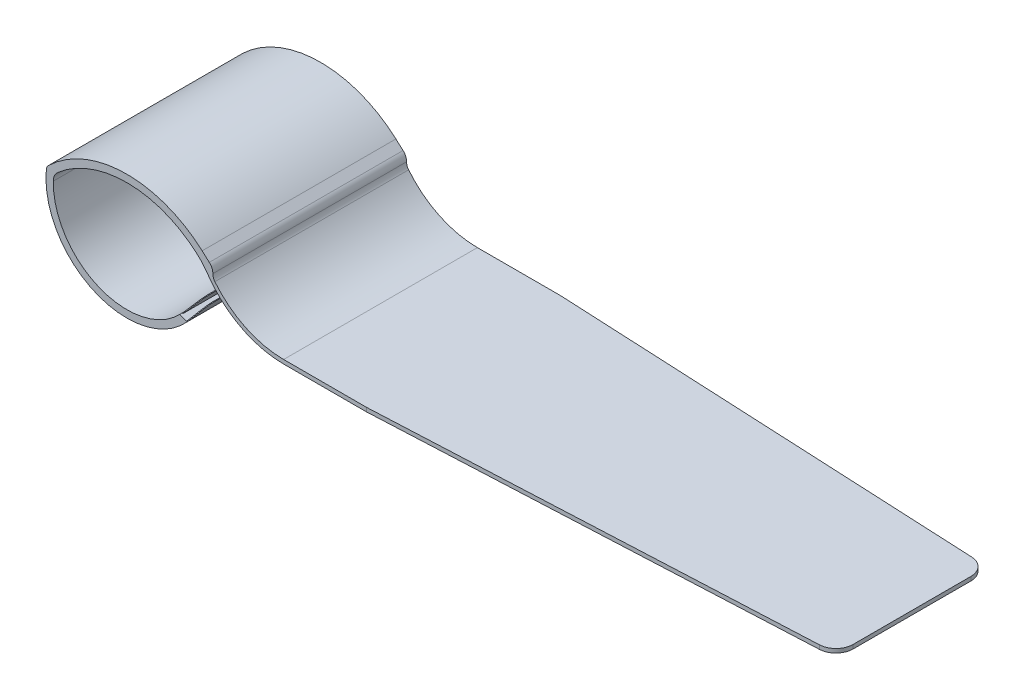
ISO-10303-21;
HEADER;
FILE_DESCRIPTION(('STEP AP214'),'2;1');
FILE_NAME('part.step','',(''),(''),'','','');
FILE_SCHEMA(('AUTOMOTIVE_DESIGN { 1 0 10303 214 1 1 1 1 }'));
ENDSEC;
DATA;
#1=APPLICATION_CONTEXT('core data for automotive mechanical design processes');
#2=APPLICATION_PROTOCOL_DEFINITION('international standard','automotive_design',2000,#1);
#3=PRODUCT_CONTEXT('',#1,'mechanical');
#4=PRODUCT('Part','Part','',(#3));
#5=PRODUCT_RELATED_PRODUCT_CATEGORY('part','',(#4));
#6=PRODUCT_DEFINITION_FORMATION('','',#4);
#7=PRODUCT_DEFINITION_CONTEXT('part definition',#1,'design');
#8=PRODUCT_DEFINITION('design','',#6,#7);
#9=PRODUCT_DEFINITION_SHAPE('','',#8);
#10=(LENGTH_UNIT() NAMED_UNIT(*) SI_UNIT(.MILLI.,.METRE.));
#11=(NAMED_UNIT(*) PLANE_ANGLE_UNIT() SI_UNIT($,.RADIAN.));
#12=(NAMED_UNIT(*) SI_UNIT($,.STERADIAN.) SOLID_ANGLE_UNIT());
#13=UNCERTAINTY_MEASURE_WITH_UNIT(LENGTH_MEASURE(1.E-05),#10,'distance_accuracy_value','');
#14=(GEOMETRIC_REPRESENTATION_CONTEXT(3) GLOBAL_UNCERTAINTY_ASSIGNED_CONTEXT((#13)) GLOBAL_UNIT_ASSIGNED_CONTEXT((#10,
#11,#12)) REPRESENTATION_CONTEXT('',''));
#15=CARTESIAN_POINT('',(0.,0.,0.));
#16=DIRECTION('',(0.,0.,1.));
#17=DIRECTION('',(1.,0.,0.));
#18=AXIS2_PLACEMENT_3D('',#15,#16,#17);
#19=CARTESIAN_POINT('',(47.2496588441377,12.0355534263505,-56.5));
#20=DIRECTION('',(0.,0.,1.));
#21=DIRECTION('',(1.,0.,0.));
#22=AXIS2_PLACEMENT_3D('',#19,#20,#21);
#23=PLANE('',#22);
#24=DIRECTION('',(0.935162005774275,-0.354220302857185,0.));
#25=VECTOR('',#24,1.);
#26=CARTESIAN_POINT('',(18.1708981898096,-19.2644756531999,-56.5));
#27=LINE('',#26,#25);
#28=CARTESIAN_POINT('',(17.9703209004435,-19.1885010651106,-56.5));
#29=VERTEX_POINT('',#28);
#30=CARTESIAN_POINT('',(18.1708981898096,-19.2644756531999,-56.5));
#31=VERTEX_POINT('',#30);
#32=EDGE_CURVE('E362',#29,#31,#27,.T.);
#33=ORIENTED_EDGE('',*,*,#32,.F.);
#34=CARTESIAN_POINT('',(0.,-3.,-56.5));
#35=DIRECTION('',(0.,0.,-1.));
#36=DIRECTION('',(1.,0.,0.));
#37=AXIS2_PLACEMENT_3D('',#34,#35,#36);
#38=CIRCLE('',#37,24.1867732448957);
#39=CARTESIAN_POINT('',(17.9939015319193,-19.1622865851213,-56.5));
#40=VERTEX_POINT('',#39);
#41=EDGE_CURVE('E606',#40,#29,#38,.T.);
#42=ORIENTED_EDGE('',*,*,#41,.F.);
#43=DIRECTION('',(0.866025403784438,-0.5,0.));
#44=VECTOR('',#43,1.);
#45=CARTESIAN_POINT('',(26.4266585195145,-24.0309411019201,-56.5));
#46=LINE('',#45,#44);
#47=EDGE_CURVE('E41',#40,#31,#46,.T.);
#48=ORIENTED_EDGE('',*,*,#47,.T.);
#49=EDGE_LOOP('',(#33,#42,#48));
#50=FACE_BOUND('',#49,.T.);
#51=ADVANCED_FACE('F33',(#50),#23,.F.);
#52=CARTESIAN_POINT('',(47.2496588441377,12.0355534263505,1.5));
#53=DIRECTION('',(0.,0.,1.));
#54=DIRECTION('',(1.,0.,0.));
#55=AXIS2_PLACEMENT_3D('',#52,#53,#54);
#56=PLANE('',#55);
#57=DIRECTION('',(-0.935162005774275,0.354220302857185,0.));
#58=VECTOR('',#57,1.);
#59=CARTESIAN_POINT('',(33.2328478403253,-24.9696351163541,1.5));
#60=LINE('',#59,#58);
#61=CARTESIAN_POINT('',(18.1708981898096,-19.2644756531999,1.50000000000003));
#62=VERTEX_POINT('',#61);
#63=CARTESIAN_POINT('',(17.9703209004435,-19.1885010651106,1.50000000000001));
#64=VERTEX_POINT('',#63);
#65=EDGE_CURVE('E357',#62,#64,#60,.T.);
#66=ORIENTED_EDGE('',*,*,#65,.F.);
#67=DIRECTION('',(0.866025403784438,-0.5,0.));
#68=VECTOR('',#67,1.);
#69=CARTESIAN_POINT('',(18.4463600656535,-19.4235136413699,1.5));
#70=LINE('',#69,#68);
#71=CARTESIAN_POINT('',(17.9939015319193,-19.1622865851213,1.5));
#72=VERTEX_POINT('',#71);
#73=EDGE_CURVE('E556',#62,#72,#70,.F.);
#74=ORIENTED_EDGE('',*,*,#73,.T.);
#75=CARTESIAN_POINT('',(0.,-3.,1.5));
#76=DIRECTION('',(0.,0.,-1.));
#77=DIRECTION('',(1.,0.,0.));
#78=AXIS2_PLACEMENT_3D('',#75,#76,#77);
#79=CIRCLE('',#78,24.1867732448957);
#80=EDGE_CURVE('E628',#72,#64,#79,.T.);
#81=ORIENTED_EDGE('',*,*,#80,.T.);
#82=EDGE_LOOP('',(#66,#74,#81));
#83=FACE_BOUND('',#82,.T.);
#84=ADVANCED_FACE('F741',(#83),#56,.T.);
#85=CARTESIAN_POINT('',(47.2496588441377,-14.7496645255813,-56.5));
#86=DIRECTION('',(0.,-1.,0.));
#87=DIRECTION('',(0.,0.,-1.));
#88=AXIS2_PLACEMENT_3D('',#85,#86,#87);
#89=PLANE('',#88);
#90=DIRECTION('',(-0.998842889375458,0.,-0.0480924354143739));
#91=VECTOR('',#90,1.);
#92=CARTESIAN_POINT('',(47.3074809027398,-14.7496645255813,-57.7009196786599));
#93=LINE('',#92,#91);
#94=CARTESIAN_POINT('',(202.49012102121,-14.7496645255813,-50.2291629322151));
#95=VERTEX_POINT('',#94);
#96=CARTESIAN_POINT('',(72.2496588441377,-14.7496645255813,-56.5));
#97=VERTEX_POINT('',#96);
#98=EDGE_CURVE('E634',#95,#97,#93,.T.);
#99=ORIENTED_EDGE('',*,*,#98,.F.);
#100=CARTESIAN_POINT('',(202.249658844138,-14.7496645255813,-45.2349484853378));
#101=DIRECTION('',(0.,-1.,0.));
#102=DIRECTION('',(0.,0.,-1.));
#103=AXIS2_PLACEMENT_3D('',#100,#101,#102);
#104=CIRCLE('',#103,5.);
#105=CARTESIAN_POINT('',(207.249658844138,-14.7496645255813,-45.2349484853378));
#106=VERTEX_POINT('',#105);
#107=EDGE_CURVE('E593',#95,#106,#104,.T.);
#108=ORIENTED_EDGE('',*,*,#107,.T.);
#109=DIRECTION('',(0.,0.,1.));
#110=VECTOR('',#109,1.);
#111=CARTESIAN_POINT('',(207.249658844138,-14.7496645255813,-56.5));
#112=LINE('',#111,#110);
#113=CARTESIAN_POINT('',(207.249658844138,-14.7496645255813,-9.76505151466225));
#114=VERTEX_POINT('',#113);
#115=EDGE_CURVE('E602',#106,#114,#112,.T.);
#116=ORIENTED_EDGE('',*,*,#115,.T.);
#117=CARTESIAN_POINT('',(202.249658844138,-14.7496645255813,-9.76505151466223));
#118=DIRECTION('',(0.,-1.,0.));
#119=DIRECTION('',(0.,0.,-1.));
#120=AXIS2_PLACEMENT_3D('',#117,#118,#119);
#121=CIRCLE('',#120,5.);
#122=CARTESIAN_POINT('',(202.49012102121,-14.7496645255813,-4.77083706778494));
#123=VERTEX_POINT('',#122);
#124=EDGE_CURVE('E598',#114,#123,#121,.T.);
#125=ORIENTED_EDGE('',*,*,#124,.T.);
#126=DIRECTION('',(0.998842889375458,0.,-0.0480924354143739));
#127=VECTOR('',#126,1.);
#128=CARTESIAN_POINT('',(50.0936145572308,-14.7496645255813,2.56677250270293));
#129=LINE('',#128,#127);
#130=CARTESIAN_POINT('',(72.2496588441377,-14.7496645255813,1.5));
#131=VERTEX_POINT('',#130);
#132=EDGE_CURVE('E631',#131,#123,#129,.T.);
#133=ORIENTED_EDGE('',*,*,#132,.F.);
#134=DIRECTION('',(1.,0.,0.));
#135=VECTOR('',#134,1.);
#136=CARTESIAN_POINT('',(47.2496588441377,-14.7496645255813,1.5));
#137=LINE('',#136,#135);
#138=CARTESIAN_POINT('',(47.2496588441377,-14.7496645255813,1.5));
#139=VERTEX_POINT('',#138);
#140=EDGE_CURVE('E626',#139,#131,#137,.T.);
#141=ORIENTED_EDGE('',*,*,#140,.F.);
#142=DIRECTION('',(0.,0.,1.));
#143=VECTOR('',#142,1.);
#144=CARTESIAN_POINT('',(47.2496588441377,-14.7496645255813,-56.5));
#145=LINE('',#144,#143);
#146=CARTESIAN_POINT('',(47.2496588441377,-14.7496645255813,-56.5));
#147=VERTEX_POINT('',#146);
#148=EDGE_CURVE('E601',#147,#139,#145,.T.);
#149=ORIENTED_EDGE('',*,*,#148,.F.);
#150=DIRECTION('',(1.,0.,0.));
#151=VECTOR('',#150,1.);
#152=CARTESIAN_POINT('',(68.2496588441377,-14.7496645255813,-56.5));
#153=LINE('',#152,#151);
#154=EDGE_CURVE('E623',#147,#97,#153,.T.);
#155=ORIENTED_EDGE('',*,*,#154,.T.);
#156=EDGE_LOOP('',(#99,#108,#116,#125,#133,#141,#149,#155));
#157=FACE_BOUND('',#156,.T.);
#158=ADVANCED_FACE('F566',(#157),#89,.T.);
#159=CARTESIAN_POINT('',(0.,-3.,-56.5));
#160=DIRECTION('',(0.,0.,1.));
#161=DIRECTION('',(1.,0.,0.));
#162=AXIS2_PLACEMENT_3D('',#159,#160,#161);
#163=CYLINDRICAL_SURFACE('',#162,24.1867732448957);
#164=DIRECTION('',(0.,0.,1.));
#165=VECTOR('',#164,1.);
#166=CARTESIAN_POINT('',(17.9703209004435,-19.1885010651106,-56.5));
#167=LINE('',#166,#165);
#168=EDGE_CURVE('E48',#64,#29,#167,.F.);
#169=ORIENTED_EDGE('',*,*,#168,.F.);
#170=ORIENTED_EDGE('',*,*,#80,.F.);
#171=CARTESIAN_POINT('',(17.9939015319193,-19.1622865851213,1.5));
#172=CARTESIAN_POINT('',(18.0876923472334,-19.0578844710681,1.50001572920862));
#173=CARTESIAN_POINT('',(18.1805622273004,-18.9526448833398,1.49434417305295));
#174=CARTESIAN_POINT('',(18.3638733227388,-18.7412698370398,1.47160930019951));
#175=CARTESIAN_POINT('',(18.4543143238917,-18.6351343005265,1.4545449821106));
#176=CARTESIAN_POINT('',(18.6321249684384,-18.4228118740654,1.40901742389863));
#177=CARTESIAN_POINT('',(18.7194959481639,-18.3166250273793,1.38055921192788));
#178=CARTESIAN_POINT('',(18.8906643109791,-18.1050094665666,1.31234922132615));
#179=CARTESIAN_POINT('',(18.9744618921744,-17.9995807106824,1.27259806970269));
#180=CARTESIAN_POINT('',(19.1380820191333,-17.7902497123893,1.18195375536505));
#181=CARTESIAN_POINT('',(19.2179004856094,-17.6863491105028,1.1310494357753));
#182=CARTESIAN_POINT('',(19.373070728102,-17.4810460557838,1.01840280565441));
#183=CARTESIAN_POINT('',(19.4484208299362,-17.3796445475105,0.956656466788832));
#184=CARTESIAN_POINT('',(19.5941985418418,-17.1803602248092,0.822790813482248));
#185=CARTESIAN_POINT('',(19.6646298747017,-17.0824747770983,0.750679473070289));
#186=CARTESIAN_POINT('',(19.8003556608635,-16.8909933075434,0.596512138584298));
#187=CARTESIAN_POINT('',(19.8656482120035,-16.7973988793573,0.514452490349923));
#188=CARTESIAN_POINT('',(19.9901100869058,-16.6164394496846,0.341979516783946));
#189=CARTESIAN_POINT('',(20.0493408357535,-16.5290155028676,0.251672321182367));
#190=CARTESIAN_POINT('',(20.1623599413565,-16.3599993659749,0.062520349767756));
#191=CARTESIAN_POINT('',(20.2161462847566,-16.2784093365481,-0.0363275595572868));
#192=CARTESIAN_POINT('',(20.3181157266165,-16.1218482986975,-0.24182787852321));
#193=CARTESIAN_POINT('',(20.3662993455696,-16.0468766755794,-0.348479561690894));
#194=CARTESIAN_POINT('',(20.456995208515,-15.9042046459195,-0.568885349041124));
#195=CARTESIAN_POINT('',(20.4995054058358,-15.8365068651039,-0.682641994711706));
#196=CARTESIAN_POINT('',(20.5789494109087,-15.7087578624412,-0.916935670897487));
#197=CARTESIAN_POINT('',(20.6158580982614,-15.6487412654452,-1.03750010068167));
#198=CARTESIAN_POINT('',(20.6838568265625,-15.5372379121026,-1.28415258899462));
#199=CARTESIAN_POINT('',(20.7149444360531,-15.4857547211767,-1.41024292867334));
#200=CARTESIAN_POINT('',(20.7712456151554,-15.3918664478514,-1.66692079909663));
#201=CARTESIAN_POINT('',(20.7964637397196,-15.3494543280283,-1.79750475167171));
#202=CARTESIAN_POINT('',(20.8410551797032,-15.2740510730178,-2.06233930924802));
#203=CARTESIAN_POINT('',(20.8604275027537,-15.2410615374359,-2.19659053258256));
#204=CARTESIAN_POINT('',(20.9000562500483,-15.1733236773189,-2.52335551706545));
#205=CARTESIAN_POINT('',(20.9174380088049,-15.1433671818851,-2.71725598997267));
#206=CARTESIAN_POINT('',(20.9347995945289,-15.1133924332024,-3.00990968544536));
#207=CARTESIAN_POINT('',(20.9391349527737,-15.1058941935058,-3.10772501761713));
#208=CARTESIAN_POINT('',(20.9449139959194,-15.0958917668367,-3.30368419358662));
#209=CARTESIAN_POINT('',(20.9463580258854,-15.0933869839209,-3.40182799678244));
#210=CARTESIAN_POINT('',(20.9463600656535,-15.0933866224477,-3.5));
#211=B_SPLINE_CURVE_WITH_KNOTS('',3,(#171,#172,#173,#174,#175,#176,#177,#178,#179,#180,#181,
#182,#183,#184,#185,#186,#187,#188,#189,#190,#191,#192,#193,#194,#195,#196,#197,#198,#199,#200,
#201,#202,#203,#204,#205,#206,#207,#208,#209,#210),.UNSPECIFIED.,.F.,.F.,(4,2,2,2,2,2,2,2,2,2,2,
2,2,2,2,2,2,2,2,4),(0.,0.420924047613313,0.841885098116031,1.26266058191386,1.68341270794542,
2.10458766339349,2.52591943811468,2.94692879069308,3.36809325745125,3.78444683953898,
4.20095383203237,4.61742210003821,5.03404020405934,5.4524747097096,5.87108360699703,
6.28936655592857,6.70772047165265,7.29705922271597,7.59151154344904,7.88592872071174),.UNSPECIFIED.);
#212=CARTESIAN_POINT('',(20.9463600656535,-15.0933866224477,-3.50000000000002));
#213=VERTEX_POINT('',#212);
#214=EDGE_CURVE('E555',#72,#213,#211,.T.);
#215=ORIENTED_EDGE('',*,*,#214,.T.);
#216=DIRECTION('',(0.,0.,1.));
#217=VECTOR('',#216,1.);
#218=CARTESIAN_POINT('',(20.9463600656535,-15.0933866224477,-56.5));
#219=LINE('',#218,#217);
#220=CARTESIAN_POINT('',(20.9463600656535,-15.0933866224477,-51.5));
#221=VERTEX_POINT('',#220);
#222=EDGE_CURVE('E618',#221,#213,#219,.T.);
#223=ORIENTED_EDGE('',*,*,#222,.F.);
#224=CARTESIAN_POINT('',(20.9463600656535,-15.0933866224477,-51.5));
#225=CARTESIAN_POINT('',(20.9463596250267,-15.0933689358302,-51.6405708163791));
#226=CARTESIAN_POINT('',(20.9433961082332,-15.0985197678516,-51.7811394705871));
#227=CARTESIAN_POINT('',(20.931539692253,-15.1190307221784,-52.0612721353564));
#228=CARTESIAN_POINT('',(20.9226470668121,-15.1343903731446,-52.2008361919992));
#229=CARTESIAN_POINT('',(20.8989372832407,-15.175177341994,-52.4778781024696));
#230=CARTESIAN_POINT('',(20.8841241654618,-15.2005977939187,-52.6153573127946));
#231=CARTESIAN_POINT('',(20.848568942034,-15.2612567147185,-52.8873492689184));
#232=CARTESIAN_POINT('',(20.8278269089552,-15.2964950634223,-53.0218620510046));
#233=CARTESIAN_POINT('',(20.7804042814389,-15.3764678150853,-53.2870104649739));
#234=CARTESIAN_POINT('',(20.7537217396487,-15.4212053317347,-53.4176448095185));
#235=CARTESIAN_POINT('',(20.6944166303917,-15.5197614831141,-53.6741072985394));
#236=CARTESIAN_POINT('',(20.6617918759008,-15.5735834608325,-53.7999336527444));
#237=CARTESIAN_POINT('',(20.5906463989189,-15.689756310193,-54.0457659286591));
#238=CARTESIAN_POINT('',(20.5521287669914,-15.7521027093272,-54.1657748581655));
#239=CARTESIAN_POINT('',(20.4692096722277,-15.8847807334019,-54.3992239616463));
#240=CARTESIAN_POINT('',(20.4248061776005,-15.9551151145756,-54.5126618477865));
#241=CARTESIAN_POINT('',(20.3302854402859,-16.1029451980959,-54.7318934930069));
#242=CARTESIAN_POINT('',(20.2801795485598,-16.1804266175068,-54.83770177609));
#243=CARTESIAN_POINT('',(20.1742872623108,-16.3419434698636,-55.0411585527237));
#244=CARTESIAN_POINT('',(20.1185009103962,-16.4259788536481,-55.1388071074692));
#245=CARTESIAN_POINT('',(20.0013824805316,-16.5998413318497,-55.3252651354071));
#246=CARTESIAN_POINT('',(19.9400492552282,-16.689669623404,-55.414072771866));
#247=CARTESIAN_POINT('',(19.8120690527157,-16.8742395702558,-55.582164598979));
#248=CARTESIAN_POINT('',(19.7454239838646,-16.9689794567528,-55.6614521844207));
#249=CARTESIAN_POINT('',(19.6075377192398,-17.1618649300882,-55.8094727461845));
#250=CARTESIAN_POINT('',(19.536331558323,-17.2599823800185,-55.8782750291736));
#251=CARTESIAN_POINT('',(19.3892542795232,-17.4593276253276,-56.005498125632));
#252=CARTESIAN_POINT('',(19.3133848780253,-17.5605542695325,-56.0639227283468));
#253=CARTESIAN_POINT('',(19.1573277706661,-17.7652751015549,-56.1700555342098));
#254=CARTESIAN_POINT('',(19.0771401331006,-17.8687692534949,-56.2177639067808));
#255=CARTESIAN_POINT('',(18.9129160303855,-18.0771091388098,-56.3021857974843));
#256=CARTESIAN_POINT('',(18.8288803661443,-18.1819545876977,-56.3389015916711));
#257=CARTESIAN_POINT('',(18.6237369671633,-18.4334701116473,-56.413400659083));
#258=CARTESIAN_POINT('',(18.5010130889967,-18.5804204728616,-56.4459577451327));
#259=CARTESIAN_POINT('',(18.3132793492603,-18.7997814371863,-56.4784291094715));
#260=CARTESIAN_POINT('',(18.2501294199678,-18.8726842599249,-56.4865255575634));
#261=CARTESIAN_POINT('',(18.1227702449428,-19.0179439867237,-56.4973099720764));
#262=CARTESIAN_POINT('',(18.0585611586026,-19.0903009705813,-56.4999987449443));
#263=CARTESIAN_POINT('',(17.9939015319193,-19.1622865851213,-56.5));
#264=B_SPLINE_CURVE_WITH_KNOTS('',3,(#224,#225,#226,#227,#228,#229,#230,#231,#232,#233,#234,
#235,#236,#237,#238,#239,#240,#241,#242,#243,#244,#245,#246,#247,#248,#249,#250,#251,#252,#253,
#254,#255,#256,#257,#258,#259,#260,#261,#262,#263),.UNSPECIFIED.,.F.,.F.,(4,2,2,2,2,2,2,2,2,2,2,
2,2,2,2,2,2,2,2,4),(0.,0.421583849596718,0.84314823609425,1.26442542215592,1.6856974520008,
2.10710778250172,2.52867352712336,2.95001893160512,3.37151016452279,3.79217660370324,
4.21283988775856,4.63359038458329,5.05419039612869,5.47187693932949,5.88941065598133,
6.30693777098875,6.72437837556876,7.30549700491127,7.59573511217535,7.88592993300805),.UNSPECIFIED.);
#265=EDGE_CURVE('E548',#221,#40,#264,.T.);
#266=ORIENTED_EDGE('',*,*,#265,.T.);
#267=ORIENTED_EDGE('',*,*,#41,.T.);
#268=EDGE_LOOP('',(#169,#170,#215,#223,#266,#267));
#269=FACE_BOUND('',#268,.T.);
#270=ADVANCED_FACE('F560',(#269),#163,.F.);
#271=CARTESIAN_POINT('',(20.9463600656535,-15.0933866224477,-56.5));
#272=DIRECTION('',(-0.5,-0.866025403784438,0.));
#273=DIRECTION('',(0.866025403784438,-0.5,0.));
#274=AXIS2_PLACEMENT_3D('',#271,#272,#273);
#275=PLANE('',#274);
#276=ORIENTED_EDGE('',*,*,#222,.T.);
#277=DIRECTION('',(0.866025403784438,-0.5,0.));
#278=VECTOR('',#277,1.);
#279=CARTESIAN_POINT('',(21.1195651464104,-15.1933866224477,-3.5));
#280=LINE('',#279,#278);
#281=CARTESIAN_POINT('',(21.1195651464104,-15.1933866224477,-3.50000000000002));
#282=VERTEX_POINT('',#281);
#283=EDGE_CURVE('E587',#213,#282,#280,.T.);
#284=ORIENTED_EDGE('',*,*,#283,.T.);
#285=DIRECTION('',(0.,0.,1.));
#286=VECTOR('',#285,1.);
#287=CARTESIAN_POINT('',(21.1195651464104,-15.1933866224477,-56.5));
#288=LINE('',#287,#286);
#289=CARTESIAN_POINT('',(21.1195651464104,-15.1933866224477,-51.5));
#290=VERTEX_POINT('',#289);
#291=EDGE_CURVE('E616',#290,#282,#288,.T.);
#292=ORIENTED_EDGE('',*,*,#291,.F.);
#293=DIRECTION('',(0.866025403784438,-0.5,0.));
#294=VECTOR('',#293,1.);
#295=CARTESIAN_POINT('',(20.9463600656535,-15.0933866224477,-51.5));
#296=LINE('',#295,#294);
#297=EDGE_CURVE('E590',#290,#221,#296,.F.);
#298=ORIENTED_EDGE('',*,*,#297,.T.);
#299=EDGE_LOOP('',(#276,#284,#292,#298));
#300=FACE_BOUND('',#299,.T.);
#301=ADVANCED_FACE('F565',(#300),#275,.F.);
#302=CARTESIAN_POINT('',(0.,-3.,-56.5));
#303=DIRECTION('',(0.,0.,1.));
#304=DIRECTION('',(1.,0.,0.));
#305=AXIS2_PLACEMENT_3D('',#302,#303,#304);
#306=CYLINDRICAL_SURFACE('',#305,24.3867732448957);
#307=CARTESIAN_POINT('',(21.1195651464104,-15.1933866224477,-3.5));
#308=CARTESIAN_POINT('',(21.1195647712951,-15.1933689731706,-3.35942821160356));
#309=CARTESIAN_POINT('',(21.1166011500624,-15.1985198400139,-3.2188585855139));
#310=CARTESIAN_POINT('',(21.1047446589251,-15.2190311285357,-2.93872400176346));
#311=CARTESIAN_POINT('',(21.0958520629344,-15.2343910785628,-2.79915899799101));
#312=CARTESIAN_POINT('',(21.0721429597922,-15.2751791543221,-2.52211540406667));
#313=CARTESIAN_POINT('',(21.0573304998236,-15.3006004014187,-2.38463545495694));
#314=CARTESIAN_POINT('',(21.0217781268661,-15.3612619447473,-2.11264206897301));
#315=CARTESIAN_POINT('',(21.0010382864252,-15.3965021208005,-1.97812859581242));
#316=CARTESIAN_POINT('',(20.953622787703,-15.4764802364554,-1.71297890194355));
#317=CARTESIAN_POINT('',(20.9269451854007,-15.5212212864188,-1.58234396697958));
#318=CARTESIAN_POINT('',(20.8676541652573,-15.6197870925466,-1.325880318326));
#319=CARTESIAN_POINT('',(20.8350385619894,-15.6736151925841,-1.20005339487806));
#320=CARTESIAN_POINT('',(20.7639172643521,-15.7898038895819,-0.954219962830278));
#321=CARTESIAN_POINT('',(20.7254146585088,-15.852160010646,-0.834210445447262));
#322=CARTESIAN_POINT('',(20.6425332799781,-15.9848622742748,-0.600760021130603));
#323=CARTESIAN_POINT('',(20.5981524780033,-16.0552111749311,-0.487321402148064));
#324=CARTESIAN_POINT('',(20.5036851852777,-16.2030785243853,-0.26808484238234));
#325=CARTESIAN_POINT('',(20.4536098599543,-16.2805828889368,-0.162272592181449));
#326=CARTESIAN_POINT('',(20.3477895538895,-16.4421535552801,0.041192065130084));
#327=CARTESIAN_POINT('',(20.2920446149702,-16.5262198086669,0.138844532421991));
#328=CARTESIAN_POINT('',(20.1750212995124,-16.7001536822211,0.325310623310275));
#329=CARTESIAN_POINT('',(20.1137417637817,-16.7900225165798,0.414122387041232));
#330=CARTESIAN_POINT('',(19.9858826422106,-16.974684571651,0.582222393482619));
#331=CARTESIAN_POINT('',(19.9193049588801,-17.0694760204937,0.661514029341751));
#332=CARTESIAN_POINT('',(19.7815593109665,-17.2624885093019,0.809551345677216));
#333=CARTESIAN_POINT('',(19.7104256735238,-17.3606818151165,0.878365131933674));
#334=CARTESIAN_POINT('',(19.5635074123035,-17.5601932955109,1.00560795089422));
#335=CARTESIAN_POINT('',(19.4877244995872,-17.6615103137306,1.06404077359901));
#336=CARTESIAN_POINT('',(19.3318550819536,-17.8664269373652,1.17018566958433));
#337=CARTESIAN_POINT('',(19.2517686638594,-17.9700264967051,1.2178979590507));
#338=CARTESIAN_POINT('',(19.087761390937,-18.1785932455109,1.3023225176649));
#339=CARTESIAN_POINT('',(19.0038413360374,-18.2835601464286,1.33903706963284));
#340=CARTESIAN_POINT('',(18.799103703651,-18.535248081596,1.41348465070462));
#341=CARTESIAN_POINT('',(18.6766829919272,-18.6822559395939,1.44600871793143));
#342=CARTESIAN_POINT('',(18.4894291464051,-18.9017294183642,1.47844859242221));
#343=CARTESIAN_POINT('',(18.426443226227,-18.9746741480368,1.48653754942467));
#344=CARTESIAN_POINT('',(18.2994198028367,-19.1200266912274,1.49731222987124));
#345=CARTESIAN_POINT('',(18.2353824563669,-19.1924345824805,1.49999875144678));
#346=CARTESIAN_POINT('',(18.1708981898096,-19.2644756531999,1.5));
#347=B_SPLINE_CURVE_WITH_KNOTS('',3,(#307,#308,#309,#310,#311,#312,#313,#314,#315,#316,#317,
#318,#319,#320,#321,#322,#323,#324,#325,#326,#327,#328,#329,#330,#331,#332,#333,#334,#335,#336,
#337,#338,#339,#340,#341,#342,#343,#344,#345,#346),.UNSPECIFIED.,.F.,.F.,(4,2,2,2,2,2,2,2,2,2,2,
2,2,2,2,2,2,2,2,4),(0.,0.421586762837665,0.843154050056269,1.26443361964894,1.68570803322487,
2.10712057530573,2.52868852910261,2.95003606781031,3.37152944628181,3.79221019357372,
4.21288783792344,4.63365379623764,5.05426933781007,5.47202203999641,5.88962190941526,
6.3072133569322,6.72471806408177,7.30538008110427,7.59539056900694,7.88535820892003),.UNSPECIFIED.);
#348=EDGE_CURVE('E579',#282,#62,#347,.T.);
#349=ORIENTED_EDGE('',*,*,#348,.T.);
#350=DIRECTION('',(0.,0.,-1.));
#351=VECTOR('',#350,1.);
#352=CARTESIAN_POINT('',(18.1708981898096,-19.2644756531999,82.5983555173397));
#353=LINE('',#352,#351);
#354=CARTESIAN_POINT('',(18.1708981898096,-19.2644756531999,1.70000000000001));
#355=VERTEX_POINT('',#354);
#356=EDGE_CURVE('E317',#355,#62,#353,.T.);
#357=ORIENTED_EDGE('',*,*,#356,.F.);
#358=CARTESIAN_POINT('',(0.,-3.,1.70000000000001));
#359=DIRECTION('',(0.,0.,1.));
#360=DIRECTION('',(1.,0.,0.));
#361=AXIS2_PLACEMENT_3D('',#358,#359,#360);
#362=CIRCLE('',#361,24.3867732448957);
#363=CARTESIAN_POINT('',(-24.2798189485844,-0.718530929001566,1.70000000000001));
#364=VERTEX_POINT('',#363);
#365=EDGE_CURVE('E314',#355,#364,#362,.F.);
#366=ORIENTED_EDGE('',*,*,#365,.T.);
#367=DIRECTION('',(0.,0.,1.));
#368=VECTOR('',#367,1.);
#369=CARTESIAN_POINT('',(-24.2798189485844,-0.718530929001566,-56.5));
#370=LINE('',#369,#368);
#371=CARTESIAN_POINT('',(-24.2798189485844,-0.718530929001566,-56.7));
#372=VERTEX_POINT('',#371);
#373=EDGE_CURVE('E295',#372,#364,#370,.T.);
#374=ORIENTED_EDGE('',*,*,#373,.F.);
#375=CARTESIAN_POINT('',(0.,-3.,-56.7));
#376=DIRECTION('',(0.,0.,-1.));
#377=DIRECTION('',(-1.,0.,0.));
#378=AXIS2_PLACEMENT_3D('',#375,#376,#377);
#379=CIRCLE('',#378,24.3867732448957);
#380=CARTESIAN_POINT('',(18.1708981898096,-19.2644756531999,-56.7));
#381=VERTEX_POINT('',#380);
#382=EDGE_CURVE('E397',#381,#372,#379,.T.);
#383=ORIENTED_EDGE('',*,*,#382,.F.);
#384=DIRECTION('',(0.,0.,1.));
#385=VECTOR('',#384,1.);
#386=CARTESIAN_POINT('',(18.1708981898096,-19.2644756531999,-137.59835551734));
#387=LINE('',#386,#385);
#388=EDGE_CURVE('E361',#381,#31,#387,.T.);
#389=ORIENTED_EDGE('',*,*,#388,.T.);
#390=CARTESIAN_POINT('',(18.1708981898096,-19.2644756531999,-56.5));
#391=CARTESIAN_POINT('',(18.2645109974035,-19.1599077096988,-56.5000157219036));
#392=CARTESIAN_POINT('',(18.3572088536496,-19.0545107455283,-56.4943396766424));
#393=CARTESIAN_POINT('',(18.5401884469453,-18.8428388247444,-56.4715888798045));
#394=CARTESIAN_POINT('',(18.6304699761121,-18.7365637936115,-56.4545131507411));
#395=CARTESIAN_POINT('',(18.8079748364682,-18.5239814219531,-56.4089579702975));
#396=CARTESIAN_POINT('',(18.8951995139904,-18.4176741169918,-56.3804836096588));
#397=CARTESIAN_POINT('',(19.0660896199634,-18.2058358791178,-56.3122382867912));
#398=CARTESIAN_POINT('',(19.1497552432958,-18.1003049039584,-56.2724679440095));
#399=CARTESIAN_POINT('',(19.3131251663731,-17.8907882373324,-56.1817842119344));
#400=CARTESIAN_POINT('',(19.3928254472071,-17.7868041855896,-56.1308597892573));
#401=CARTESIAN_POINT('',(19.5477743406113,-17.5813507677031,-56.0181728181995));
#402=CARTESIAN_POINT('',(19.6230212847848,-17.4798823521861,-55.9564062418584));
#403=CARTESIAN_POINT('',(19.7686079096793,-17.280479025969,-55.8225005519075));
#404=CARTESIAN_POINT('',(19.8389512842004,-17.1825414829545,-55.7503693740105));
#405=CARTESIAN_POINT('',(19.97451536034,-16.9909693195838,-55.5961634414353));
#406=CARTESIAN_POINT('',(20.0397341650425,-16.8973362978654,-55.5140850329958));
#407=CARTESIAN_POINT('',(20.1640736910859,-16.7162957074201,-55.3415606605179));
#408=CARTESIAN_POINT('',(20.2232547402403,-16.6288299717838,-55.251219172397));
#409=CARTESIAN_POINT('',(20.3361841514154,-16.459742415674,-55.0619970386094));
#410=CARTESIAN_POINT('',(20.3899305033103,-16.3781227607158,-54.9631132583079));
#411=CARTESIAN_POINT('',(20.4918280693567,-16.2215135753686,-54.7575401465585));
#412=CARTESIAN_POINT('',(20.5399798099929,-16.1465234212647,-54.6508515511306));
#413=CARTESIAN_POINT('',(20.6306183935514,-16.003824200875,-54.4303711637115));
#414=CARTESIAN_POINT('',(20.6731031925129,-15.9361177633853,-54.3165768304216));
#415=CARTESIAN_POINT('',(20.7524983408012,-15.8083646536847,-54.0822153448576));
#416=CARTESIAN_POINT('',(20.7893839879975,-15.7483520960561,-53.9616212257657));
#417=CARTESIAN_POINT('',(20.8573405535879,-15.6368635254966,-53.7149101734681));
#418=CARTESIAN_POINT('',(20.8884090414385,-15.5853910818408,-53.588790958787));
#419=CARTESIAN_POINT('',(20.9446743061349,-15.4915300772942,-53.332056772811));
#420=CARTESIAN_POINT('',(20.9698756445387,-15.4491344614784,-53.2014453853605));
#421=CARTESIAN_POINT('',(21.0144345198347,-15.3737690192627,-52.9365575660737));
#422=CARTESIAN_POINT('',(21.0337910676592,-15.3408007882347,-52.802280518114));
#423=CARTESIAN_POINT('',(21.0733555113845,-15.2731637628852,-52.4756718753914));
#424=CARTESIAN_POINT('',(21.090701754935,-15.243266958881,-52.2819609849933));
#425=CARTESIAN_POINT('',(21.1080280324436,-15.2133521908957,-51.9895976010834));
#426=CARTESIAN_POINT('',(21.1123546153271,-15.2058690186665,-51.8918802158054));
#427=CARTESIAN_POINT('',(21.1181219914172,-15.1958867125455,-51.6961178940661));
#428=CARTESIAN_POINT('',(21.1195631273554,-15.1933869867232,-51.5980729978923));
#429=CARTESIAN_POINT('',(21.1195651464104,-15.1933866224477,-51.5));
#430=B_SPLINE_CURVE_WITH_KNOTS('',3,(#390,#391,#392,#393,#394,#395,#396,#397,#398,#399,#400,
#401,#402,#403,#404,#405,#406,#407,#408,#409,#410,#411,#412,#413,#414,#415,#416,#417,#418,#419,
#420,#421,#422,#423,#424,#425,#426,#427,#428,#429),.UNSPECIFIED.,.F.,.F.,(4,2,2,2,2,2,2,2,2,2,2,
2,2,2,2,2,2,2,2,4),(0.,0.420937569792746,0.841911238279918,1.26269710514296,1.68345990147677,
2.10464080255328,2.52597850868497,2.9469953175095,3.3681672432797,3.78460292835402,
4.20119208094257,4.61774199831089,5.03444175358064,5.45292956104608,5.87159183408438,
6.28992751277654,6.70833394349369,7.29708114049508,7.5912365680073,7.88535705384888),.UNSPECIFIED.);
#431=EDGE_CURVE('E540',#31,#290,#430,.T.);
#432=ORIENTED_EDGE('',*,*,#431,.T.);
#433=ORIENTED_EDGE('',*,*,#291,.T.);
#434=EDGE_LOOP('',(#349,#357,#366,#374,#383,#389,#432,#433));
#435=FACE_BOUND('',#434,.T.);
#436=ADVANCED_FACE('F571',(#435),#306,.T.);
#437=CARTESIAN_POINT('',(-22.0894675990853,-0.924348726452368,-56.5));
#438=DIRECTION('',(0.,0.,1.));
#439=DIRECTION('',(1.,0.,0.));
#440=AXIS2_PLACEMENT_3D('',#437,#438,#439);
#441=CYLINDRICAL_SURFACE('',#440,2.20000000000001);
#442=ORIENTED_EDGE('',*,*,#373,.T.);
#443=CARTESIAN_POINT('',(-22.0894675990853,-0.924348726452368,1.70000000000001));
#444=DIRECTION('',(0.,0.,1.));
#445=DIRECTION('',(1.,0.,0.));
#446=AXIS2_PLACEMENT_3D('',#443,#444,#445);
#447=CIRCLE('',#446,2.20000000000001);
#448=CARTESIAN_POINT('',(-23.6176697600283,0.658243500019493,1.70000000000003));
#449=VERTEX_POINT('',#448);
#450=EDGE_CURVE('E303',#364,#449,#447,.F.);
#451=ORIENTED_EDGE('',*,*,#450,.T.);
#452=DIRECTION('',(0.,0.,1.));
#453=VECTOR('',#452,1.);
#454=CARTESIAN_POINT('',(-23.6176697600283,0.658243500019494,-56.5));
#455=LINE('',#454,#453);
#456=CARTESIAN_POINT('',(-23.6176697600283,0.658243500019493,-56.7));
#457=VERTEX_POINT('',#456);
#458=EDGE_CURVE('E285',#457,#449,#455,.T.);
#459=ORIENTED_EDGE('',*,*,#458,.F.);
#460=CARTESIAN_POINT('',(-22.0894675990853,-0.924348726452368,-56.7));
#461=DIRECTION('',(0.,0.,-1.));
#462=DIRECTION('',(-1.,0.,0.));
#463=AXIS2_PLACEMENT_3D('',#460,#461,#462);
#464=CIRCLE('',#463,2.20000000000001);
#465=EDGE_CURVE('E395',#372,#457,#464,.T.);
#466=ORIENTED_EDGE('',*,*,#465,.F.);
#467=EDGE_LOOP('',(#442,#451,#459,#466));
#468=FACE_BOUND('',#467,.T.);
#469=ADVANCED_FACE('F309',(#468),#441,.T.);
#470=CARTESIAN_POINT('',(0.,-23.8,-56.5));
#471=DIRECTION('',(0.,0.,1.));
#472=DIRECTION('',(1.,0.,0.));
#473=AXIS2_PLACEMENT_3D('',#470,#471,#472);
#474=CYLINDRICAL_SURFACE('',#473,34.);
#475=ORIENTED_EDGE('',*,*,#458,.T.);
#476=CARTESIAN_POINT('',(0.,-23.8,1.70000000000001));
#477=DIRECTION('',(0.,0.,1.));
#478=DIRECTION('',(1.,0.,0.));
#479=AXIS2_PLACEMENT_3D('',#476,#477,#478);
#480=CIRCLE('',#479,34.);
#481=CARTESIAN_POINT('',(22.6830937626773,1.52740131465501,1.70000000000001));
#482=VERTEX_POINT('',#481);
#483=EDGE_CURVE('E288',#449,#482,#480,.F.);
#484=ORIENTED_EDGE('',*,*,#483,.T.);
#485=DIRECTION('',(0.,0.,1.));
#486=VECTOR('',#485,1.);
#487=CARTESIAN_POINT('',(22.6830937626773,1.52740131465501,-56.5));
#488=LINE('',#487,#486);
#489=CARTESIAN_POINT('',(22.6830937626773,1.52740131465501,-56.7));
#490=VERTEX_POINT('',#489);
#491=EDGE_CURVE('E296',#490,#482,#488,.T.);
#492=ORIENTED_EDGE('',*,*,#491,.F.);
#493=CARTESIAN_POINT('',(0.,-23.8,-56.7));
#494=DIRECTION('',(0.,0.,-1.));
#495=DIRECTION('',(-1.,0.,0.));
#496=AXIS2_PLACEMENT_3D('',#493,#494,#495);
#497=CIRCLE('',#496,34.);
#498=EDGE_CURVE('E290',#457,#490,#497,.T.);
#499=ORIENTED_EDGE('',*,*,#498,.F.);
#500=EDGE_LOOP('',(#475,#484,#492,#499));
#501=FACE_BOUND('',#500,.T.);
#502=ADVANCED_FACE('F287',(#501),#474,.T.);
#503=CARTESIAN_POINT('',(22.6830937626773,1.52740131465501,-56.5));
#504=DIRECTION('',(-0.667149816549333,-0.744923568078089,0.));
#505=DIRECTION('',(0.744923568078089,-0.667149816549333,0.));
#506=AXIS2_PLACEMENT_3D('',#503,#504,#505);
#507=PLANE('',#506);
#508=ORIENTED_EDGE('',*,*,#491,.T.);
#509=DIRECTION('',(0.744923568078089,-0.667149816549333,0.));
#510=VECTOR('',#509,1.);
#511=CARTESIAN_POINT('',(22.6830937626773,1.52740131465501,1.70000000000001));
#512=LINE('',#511,#510);
#513=CARTESIAN_POINT('',(24.8393595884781,-0.403739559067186,1.70000000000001));
#514=VERTEX_POINT('',#513);
#515=EDGE_CURVE('E307',#482,#514,#512,.T.);
#516=ORIENTED_EDGE('',*,*,#515,.T.);
#517=DIRECTION('',(0.,0.,1.));
#518=VECTOR('',#517,1.);
#519=CARTESIAN_POINT('',(24.8393595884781,-0.403739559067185,-56.5));
#520=LINE('',#519,#518);
#521=CARTESIAN_POINT('',(24.8393595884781,-0.403739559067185,-56.7));
#522=VERTEX_POINT('',#521);
#523=EDGE_CURVE('E612',#522,#514,#520,.T.);
#524=ORIENTED_EDGE('',*,*,#523,.F.);
#525=DIRECTION('',(0.744923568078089,-0.667149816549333,0.));
#526=VECTOR('',#525,1.);
#527=CARTESIAN_POINT('',(22.6830937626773,1.52740131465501,-56.7));
#528=LINE('',#527,#526);
#529=EDGE_CURVE('E391',#490,#522,#528,.T.);
#530=ORIENTED_EDGE('',*,*,#529,.F.);
#531=EDGE_LOOP('',(#508,#516,#524,#530));
#532=FACE_BOUND('',#531,.T.);
#533=ADVANCED_FACE('F804',(#532),#507,.F.);
#534=CARTESIAN_POINT('',(22.7044801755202,-2.78749497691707,-56.5));
#535=DIRECTION('',(0.,0.,1.));
#536=DIRECTION('',(1.,0.,0.));
#537=AXIS2_PLACEMENT_3D('',#534,#535,#536);
#538=CYLINDRICAL_SURFACE('',#537,3.2);
#539=ORIENTED_EDGE('',*,*,#523,.T.);
#540=CARTESIAN_POINT('',(22.7044801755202,-2.78749497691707,1.70000000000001));
#541=DIRECTION('',(0.,0.,1.));
#542=DIRECTION('',(1.,0.,0.));
#543=AXIS2_PLACEMENT_3D('',#540,#541,#542);
#544=CIRCLE('',#543,3.2);
#545=CARTESIAN_POINT('',(25.9042634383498,-2.82473837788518,1.70000000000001));
#546=VERTEX_POINT('',#545);
#547=EDGE_CURVE('E344',#514,#546,#544,.F.);
#548=ORIENTED_EDGE('',*,*,#547,.T.);
#549=DIRECTION('',(0.,0.,1.));
#550=VECTOR('',#549,1.);
#551=CARTESIAN_POINT('',(25.9042634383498,-2.82473837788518,-56.5));
#552=LINE('',#551,#550);
#553=CARTESIAN_POINT('',(25.9042634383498,-2.82473837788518,-56.7));
#554=VERTEX_POINT('',#553);
#555=EDGE_CURVE('E610',#554,#546,#552,.T.);
#556=ORIENTED_EDGE('',*,*,#555,.F.);
#557=CARTESIAN_POINT('',(22.7044801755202,-2.78749497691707,-56.7));
#558=DIRECTION('',(0.,0.,-1.));
#559=DIRECTION('',(-1.,0.,0.));
#560=AXIS2_PLACEMENT_3D('',#557,#558,#559);
#561=CIRCLE('',#560,3.2);
#562=EDGE_CURVE('E388',#522,#554,#561,.T.);
#563=ORIENTED_EDGE('',*,*,#562,.F.);
#564=EDGE_LOOP('',(#539,#548,#556,#563));
#565=FACE_BOUND('',#564,.T.);
#566=ADVANCED_FACE('F802',(#565),#538,.T.);
#567=CARTESIAN_POINT('',(28.7040737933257,-2.85732635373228,-56.5));
#568=DIRECTION('',(0.,0.,1.));
#569=DIRECTION('',(1.,0.,0.));
#570=AXIS2_PLACEMENT_3D('',#567,#568,#569);
#571=CYLINDRICAL_SURFACE('',#570,2.8);
#572=ORIENTED_EDGE('',*,*,#555,.T.);
#573=CARTESIAN_POINT('',(28.7040737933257,-2.85732635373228,1.70000000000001));
#574=DIRECTION('',(0.,0.,1.));
#575=DIRECTION('',(1.,0.,0.));
#576=AXIS2_PLACEMENT_3D('',#573,#574,#575);
#577=CIRCLE('',#576,2.8);
#578=CARTESIAN_POINT('',(26.5208842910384,-4.61051875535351,1.70000000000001));
#579=VERTEX_POINT('',#578);
#580=EDGE_CURVE('E341',#546,#579,#577,.T.);
#581=ORIENTED_EDGE('',*,*,#580,.T.);
#582=DIRECTION('',(0.,0.,1.));
#583=VECTOR('',#582,1.);
#584=CARTESIAN_POINT('',(26.5208842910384,-4.61051875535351,-56.5));
#585=LINE('',#584,#583);
#586=CARTESIAN_POINT('',(26.5208842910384,-4.61051875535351,-56.7));
#587=VERTEX_POINT('',#586);
#588=EDGE_CURVE('E608',#587,#579,#585,.T.);
#589=ORIENTED_EDGE('',*,*,#588,.F.);
#590=CARTESIAN_POINT('',(28.7040737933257,-2.85732635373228,-56.7));
#591=DIRECTION('',(0.,0.,-1.));
#592=DIRECTION('',(-1.,0.,0.));
#593=AXIS2_PLACEMENT_3D('',#590,#591,#592);
#594=CIRCLE('',#593,2.8);
#595=EDGE_CURVE('E385',#554,#587,#594,.F.);
#596=ORIENTED_EDGE('',*,*,#595,.F.);
#597=EDGE_LOOP('',(#572,#581,#589,#596));
#598=FACE_BOUND('',#597,.T.);
#599=ADVANCED_FACE('F798',(#598),#571,.F.);
#600=CARTESIAN_POINT('',(47.2496588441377,12.0355534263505,-56.5));
#601=DIRECTION('',(0.,0.,1.));
#602=DIRECTION('',(1.,0.,0.));
#603=AXIS2_PLACEMENT_3D('',#600,#601,#602);
#604=CYLINDRICAL_SURFACE('',#603,26.5852179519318);
#605=ORIENTED_EDGE('',*,*,#588,.T.);
#606=CARTESIAN_POINT('',(47.2496588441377,12.0355534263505,1.70000000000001));
#607=DIRECTION('',(0.,0.,1.));
#608=DIRECTION('',(1.,0.,0.));
#609=AXIS2_PLACEMENT_3D('',#606,#607,#608);
#610=CIRCLE('',#609,26.5852179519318);
#611=CARTESIAN_POINT('',(47.2496588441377,-14.5496645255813,1.70000000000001));
#612=VERTEX_POINT('',#611);
#613=EDGE_CURVE('E338',#579,#612,#610,.T.);
#614=ORIENTED_EDGE('',*,*,#613,.T.);
#615=DIRECTION('',(0.,0.,1.));
#616=VECTOR('',#615,1.);
#617=CARTESIAN_POINT('',(47.2496588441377,-14.5496645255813,-56.5));
#618=LINE('',#617,#616);
#619=CARTESIAN_POINT('',(47.2496588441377,-14.5496645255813,-56.7));
#620=VERTEX_POINT('',#619);
#621=EDGE_CURVE('E605',#620,#612,#618,.T.);
#622=ORIENTED_EDGE('',*,*,#621,.F.);
#623=CARTESIAN_POINT('',(47.2496588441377,12.0355534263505,-56.7));
#624=DIRECTION('',(0.,0.,-1.));
#625=DIRECTION('',(-1.,0.,0.));
#626=AXIS2_PLACEMENT_3D('',#623,#624,#625);
#627=CIRCLE('',#626,26.5852179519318);
#628=EDGE_CURVE('E382',#587,#620,#627,.F.);
#629=ORIENTED_EDGE('',*,*,#628,.F.);
#630=EDGE_LOOP('',(#605,#614,#622,#629));
#631=FACE_BOUND('',#630,.T.);
#632=ADVANCED_FACE('F795',(#631),#604,.F.);
#633=CARTESIAN_POINT('',(47.2496588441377,-14.5496645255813,-56.5));
#634=DIRECTION('',(0.,-1.,0.));
#635=DIRECTION('',(0.,0.,-1.));
#636=AXIS2_PLACEMENT_3D('',#633,#634,#635);
#637=PLANE('',#636);
#638=ORIENTED_EDGE('',*,*,#621,.T.);
#639=DIRECTION('',(-1.,0.,0.));
#640=VECTOR('',#639,1.);
#641=CARTESIAN_POINT('',(47.2496588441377,-14.5496645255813,1.7));
#642=LINE('',#641,#640);
#643=CARTESIAN_POINT('',(72.2544708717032,-14.5496645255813,1.7));
#644=VERTEX_POINT('',#643);
#645=EDGE_CURVE('E684',#612,#644,#642,.F.);
#646=ORIENTED_EDGE('',*,*,#645,.T.);
#647=DIRECTION('',(0.998842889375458,0.,-0.0480924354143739));
#648=VECTOR('',#647,1.);
#649=CARTESIAN_POINT('',(72.2592773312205,-14.5496645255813,1.69976857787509));
#650=LINE('',#649,#648);
#651=CARTESIAN_POINT('',(202.499739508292,-14.5496645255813,-4.57106848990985));
#652=VERTEX_POINT('',#651);
#653=EDGE_CURVE('E681',#644,#652,#650,.T.);
#654=ORIENTED_EDGE('',*,*,#653,.T.);
#655=CARTESIAN_POINT('',(202.249658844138,-14.5496645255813,-9.76505151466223));
#656=DIRECTION('',(0.,1.,0.));
#657=DIRECTION('',(-1.,0.,0.));
#658=AXIS2_PLACEMENT_3D('',#655,#656,#657);
#659=CIRCLE('',#658,5.2);
#660=CARTESIAN_POINT('',(207.449658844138,-14.5496645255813,-9.76505151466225));
#661=VERTEX_POINT('',#660);
#662=EDGE_CURVE('E678',#652,#661,#659,.T.);
#663=ORIENTED_EDGE('',*,*,#662,.T.);
#664=DIRECTION('',(0.,0.,1.));
#665=VECTOR('',#664,1.);
#666=CARTESIAN_POINT('',(207.449658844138,-14.5496645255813,-9.76505151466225));
#667=LINE('',#666,#665);
#668=CARTESIAN_POINT('',(207.449658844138,-14.5496645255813,-45.2349484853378));
#669=VERTEX_POINT('',#668);
#670=EDGE_CURVE('E675',#661,#669,#667,.F.);
#671=ORIENTED_EDGE('',*,*,#670,.T.);
#672=CARTESIAN_POINT('',(202.249658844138,-14.5496645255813,-45.2349484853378));
#673=DIRECTION('',(0.,1.,0.));
#674=DIRECTION('',(-1.,0.,0.));
#675=AXIS2_PLACEMENT_3D('',#672,#673,#674);
#676=CIRCLE('',#675,5.2);
#677=CARTESIAN_POINT('',(202.499739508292,-14.5496645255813,-50.4289315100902));
#678=VERTEX_POINT('',#677);
#679=EDGE_CURVE('E672',#669,#678,#676,.T.);
#680=ORIENTED_EDGE('',*,*,#679,.T.);
#681=DIRECTION('',(-0.998842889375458,0.,-0.0480924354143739));
#682=VECTOR('',#681,1.);
#683=CARTESIAN_POINT('',(202.499739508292,-14.5496645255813,-50.4289315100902));
#684=LINE('',#683,#682);
#685=CARTESIAN_POINT('',(72.2544708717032,-14.5496645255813,-56.7));
#686=VERTEX_POINT('',#685);
#687=EDGE_CURVE('E645',#678,#686,#684,.T.);
#688=ORIENTED_EDGE('',*,*,#687,.T.);
#689=DIRECTION('',(-1.,0.,0.));
#690=VECTOR('',#689,1.);
#691=CARTESIAN_POINT('',(72.2496588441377,-14.5496645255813,-56.7));
#692=LINE('',#691,#690);
#693=EDGE_CURVE('E687',#686,#620,#692,.T.);
#694=ORIENTED_EDGE('',*,*,#693,.T.);
#695=EDGE_LOOP('',(#638,#646,#654,#663,#671,#680,#688,#694));
#696=FACE_BOUND('',#695,.T.);
#697=ADVANCED_FACE('F35',(#696),#637,.F.);
#698=CARTESIAN_POINT('',(18.4463600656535,-19.4235136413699,-3.5));
#699=DIRECTION('',(-0.866025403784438,0.5,0.));
#700=DIRECTION('',(-0.5,-0.866025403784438,0.));
#701=AXIS2_PLACEMENT_3D('',#698,#699,#700);
#702=CYLINDRICAL_SURFACE('',#701,5.);
#703=ORIENTED_EDGE('',*,*,#214,.F.);
#704=ORIENTED_EDGE('',*,*,#73,.F.);
#705=ORIENTED_EDGE('',*,*,#348,.F.);
#706=ORIENTED_EDGE('',*,*,#283,.F.);
#707=EDGE_LOOP('',(#703,#704,#705,#706));
#708=FACE_BOUND('',#707,.T.);
#709=ADVANCED_FACE('F534',(#708),#702,.T.);
#710=CARTESIAN_POINT('',(26.4266585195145,-24.0309411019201,-51.5));
#711=DIRECTION('',(0.866025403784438,-0.5,0.));
#712=DIRECTION('',(0.5,0.866025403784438,0.));
#713=AXIS2_PLACEMENT_3D('',#710,#711,#712);
#714=CYLINDRICAL_SURFACE('',#713,5.);
#715=ORIENTED_EDGE('',*,*,#265,.F.);
#716=ORIENTED_EDGE('',*,*,#297,.F.);
#717=ORIENTED_EDGE('',*,*,#431,.F.);
#718=ORIENTED_EDGE('',*,*,#47,.F.);
#719=EDGE_LOOP('',(#715,#716,#717,#718));
#720=FACE_BOUND('',#719,.T.);
#721=ADVANCED_FACE('F527',(#720),#714,.T.);
#722=CARTESIAN_POINT('',(72.2496588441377,-186.262420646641,-56.5));
#723=DIRECTION('',(0.,0.,-1.));
#724=DIRECTION('',(-1.,0.,0.));
#725=AXIS2_PLACEMENT_3D('',#722,#723,#724);
#726=PLANE('',#725);
#727=ORIENTED_EDGE('',*,*,#154,.F.);
#728=DIRECTION('',(0.,-1.,0.));
#729=VECTOR('',#728,1.);
#730=CARTESIAN_POINT('',(47.2496588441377,-14.5496645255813,-56.5));
#731=LINE('',#730,#729);
#732=CARTESIAN_POINT('',(47.2496588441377,-15.5496645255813,-56.5));
#733=VERTEX_POINT('',#732);
#734=EDGE_CURVE('E310',#147,#733,#731,.T.);
#735=ORIENTED_EDGE('',*,*,#734,.T.);
#736=DIRECTION('',(1.,0.,0.));
#737=VECTOR('',#736,1.);
#738=CARTESIAN_POINT('',(68.2496588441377,-15.5496645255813,-56.5));
#739=LINE('',#738,#737);
#740=CARTESIAN_POINT('',(72.2496588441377,-15.5496645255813,-56.5));
#741=VERTEX_POINT('',#740);
#742=EDGE_CURVE('E56',#733,#741,#739,.T.);
#743=ORIENTED_EDGE('',*,*,#742,.T.);
#744=DIRECTION('',(0.,1.,0.));
#745=VECTOR('',#744,1.);
#746=CARTESIAN_POINT('',(72.2496588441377,-186.262420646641,-56.5));
#747=LINE('',#746,#745);
#748=EDGE_CURVE('E642',#741,#97,#747,.T.);
#749=ORIENTED_EDGE('',*,*,#748,.T.);
#750=EDGE_LOOP('',(#727,#735,#743,#749));
#751=FACE_BOUND('',#750,.T.);
#752=ADVANCED_FACE('F523',(#751),#726,.F.);
#753=CARTESIAN_POINT('',(202.49012102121,-186.262420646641,-50.2291629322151));
#754=DIRECTION('',(0.0480924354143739,0.,-0.998842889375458));
#755=DIRECTION('',(-0.998842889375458,0.,-0.0480924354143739));
#756=AXIS2_PLACEMENT_3D('',#753,#754,#755);
#757=PLANE('',#756);
#758=ORIENTED_EDGE('',*,*,#748,.F.);
#759=DIRECTION('',(0.998842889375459,0.,0.0480924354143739));
#760=VECTOR('',#759,1.);
#761=CARTESIAN_POINT('',(57.1105497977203,-15.5496645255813,-57.2289200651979));
#762=LINE('',#761,#760);
#763=CARTESIAN_POINT('',(202.49012102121,-15.5496645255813,-50.2291629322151));
#764=VERTEX_POINT('',#763);
#765=EDGE_CURVE('E369',#741,#764,#762,.T.);
#766=ORIENTED_EDGE('',*,*,#765,.T.);
#767=DIRECTION('',(0.,1.,0.));
#768=VECTOR('',#767,1.);
#769=CARTESIAN_POINT('',(202.49012102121,-186.262420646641,-50.2291629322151));
#770=LINE('',#769,#768);
#771=EDGE_CURVE('E644',#764,#95,#770,.T.);
#772=ORIENTED_EDGE('',*,*,#771,.T.);
#773=ORIENTED_EDGE('',*,*,#98,.T.);
#774=EDGE_LOOP('',(#758,#766,#772,#773));
#775=FACE_BOUND('',#774,.T.);
#776=ADVANCED_FACE('F519',(#775),#757,.F.);
#777=CARTESIAN_POINT('',(202.249658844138,-186.262420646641,-45.2349484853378));
#778=DIRECTION('',(0.,1.,0.));
#779=DIRECTION('',(0.,0.,1.));
#780=AXIS2_PLACEMENT_3D('',#777,#778,#779);
#781=CYLINDRICAL_SURFACE('',#780,5.);
#782=ORIENTED_EDGE('',*,*,#771,.F.);
#783=CARTESIAN_POINT('',(202.249658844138,-15.5496645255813,-45.2349484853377));
#784=DIRECTION('',(0.,1.,0.));
#785=DIRECTION('',(0.,0.,1.));
#786=AXIS2_PLACEMENT_3D('',#783,#784,#785);
#787=CIRCLE('',#786,5.);
#788=CARTESIAN_POINT('',(207.249658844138,-15.5496645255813,-45.2349484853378));
#789=VERTEX_POINT('',#788);
#790=EDGE_CURVE('E690',#789,#764,#787,.T.);
#791=ORIENTED_EDGE('',*,*,#790,.F.);
#792=DIRECTION('',(0.,1.,0.));
#793=VECTOR('',#792,1.);
#794=CARTESIAN_POINT('',(207.249658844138,-186.262420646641,-45.2349484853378));
#795=LINE('',#794,#793);
#796=EDGE_CURVE('E647',#789,#106,#795,.T.);
#797=ORIENTED_EDGE('',*,*,#796,.T.);
#798=ORIENTED_EDGE('',*,*,#107,.F.);
#799=EDGE_LOOP('',(#782,#791,#797,#798));
#800=FACE_BOUND('',#799,.T.);
#801=ADVANCED_FACE('F515',(#800),#781,.F.);
#802=CARTESIAN_POINT('',(207.249658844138,-186.262420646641,-9.76505151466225));
#803=DIRECTION('',(1.,0.,0.));
#804=DIRECTION('',(0.,0.,-1.));
#805=AXIS2_PLACEMENT_3D('',#802,#803,#804);
#806=PLANE('',#805);
#807=ORIENTED_EDGE('',*,*,#796,.F.);
#808=DIRECTION('',(0.,0.,1.));
#809=VECTOR('',#808,1.);
#810=CARTESIAN_POINT('',(207.249658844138,-15.5496645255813,-288.579646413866));
#811=LINE('',#810,#809);
#812=CARTESIAN_POINT('',(207.249658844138,-15.5496645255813,-9.76505151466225));
#813=VERTEX_POINT('',#812);
#814=EDGE_CURVE('E421',#789,#813,#811,.T.);
#815=ORIENTED_EDGE('',*,*,#814,.T.);
#816=DIRECTION('',(0.,1.,0.));
#817=VECTOR('',#816,1.);
#818=CARTESIAN_POINT('',(207.249658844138,-186.262420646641,-9.76505151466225));
#819=LINE('',#818,#817);
#820=EDGE_CURVE('E649',#813,#114,#819,.T.);
#821=ORIENTED_EDGE('',*,*,#820,.T.);
#822=ORIENTED_EDGE('',*,*,#115,.F.);
#823=EDGE_LOOP('',(#807,#815,#821,#822));
#824=FACE_BOUND('',#823,.T.);
#825=ADVANCED_FACE('F511',(#824),#806,.F.);
#826=CARTESIAN_POINT('',(202.249658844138,-186.262420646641,-9.76505151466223));
#827=DIRECTION('',(0.,1.,0.));
#828=DIRECTION('',(0.,0.,1.));
#829=AXIS2_PLACEMENT_3D('',#826,#827,#828);
#830=CYLINDRICAL_SURFACE('',#829,5.);
#831=ORIENTED_EDGE('',*,*,#820,.F.);
#832=CARTESIAN_POINT('',(202.249658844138,-15.5496645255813,-9.76505151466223));
#833=DIRECTION('',(0.,1.,0.));
#834=DIRECTION('',(0.,0.,1.));
#835=AXIS2_PLACEMENT_3D('',#832,#833,#834);
#836=CIRCLE('',#835,5.);
#837=CARTESIAN_POINT('',(202.49012102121,-15.5496645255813,-4.77083706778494));
#838=VERTEX_POINT('',#837);
#839=EDGE_CURVE('E714',#838,#813,#836,.T.);
#840=ORIENTED_EDGE('',*,*,#839,.F.);
#841=DIRECTION('',(0.,1.,0.));
#842=VECTOR('',#841,1.);
#843=CARTESIAN_POINT('',(202.49012102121,-186.262420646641,-4.77083706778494));
#844=LINE('',#843,#842);
#845=EDGE_CURVE('E651',#838,#123,#844,.T.);
#846=ORIENTED_EDGE('',*,*,#845,.T.);
#847=ORIENTED_EDGE('',*,*,#124,.F.);
#848=EDGE_LOOP('',(#831,#840,#846,#847));
#849=FACE_BOUND('',#848,.T.);
#850=ADVANCED_FACE('F507',(#849),#830,.F.);
#851=CARTESIAN_POINT('',(72.2496588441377,-186.262420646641,1.5));
#852=DIRECTION('',(0.0480924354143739,0.,0.998842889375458));
#853=DIRECTION('',(0.998842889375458,0.,-0.0480924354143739));
#854=AXIS2_PLACEMENT_3D('',#851,#852,#853);
#855=PLANE('',#854);
#856=DIRECTION('',(-0.998842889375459,0.,0.0480924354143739));
#857=VECTOR('',#856,1.);
#858=CARTESIAN_POINT('',(82.1934046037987,-15.5496645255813,1.02122705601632));
#859=LINE('',#858,#857);
#860=CARTESIAN_POINT('',(82.6342742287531,-15.5496645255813,1.));
#861=VERTEX_POINT('',#860);
#862=EDGE_CURVE('E411',#838,#861,#859,.T.);
#863=ORIENTED_EDGE('',*,*,#862,.T.);
#864=DIRECTION('',(0.,-1.,0.));
#865=VECTOR('',#864,1.);
#866=CARTESIAN_POINT('',(82.6342742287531,-3.,1.));
#867=LINE('',#866,#865);
#868=CARTESIAN_POINT('',(82.634274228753,-15.7496645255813,1.00000000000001));
#869=VERTEX_POINT('',#868);
#870=EDGE_CURVE('E407',#861,#869,#867,.T.);
#871=ORIENTED_EDGE('',*,*,#870,.T.);
#872=DIRECTION('',(-0.998842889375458,0.,0.0480924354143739));
#873=VECTOR('',#872,1.);
#874=CARTESIAN_POINT('',(72.2496588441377,-15.7496645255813,1.5));
#875=LINE('',#874,#873);
#876=CARTESIAN_POINT('',(72.2496588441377,-15.7496645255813,1.5));
#877=VERTEX_POINT('',#876);
#878=EDGE_CURVE('E640',#869,#877,#875,.T.);
#879=ORIENTED_EDGE('',*,*,#878,.T.);
#880=DIRECTION('',(0.,1.,0.));
#881=VECTOR('',#880,1.);
#882=CARTESIAN_POINT('',(72.2496588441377,-186.262420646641,1.5));
#883=LINE('',#882,#881);
#884=EDGE_CURVE('E653',#877,#131,#883,.T.);
#885=ORIENTED_EDGE('',*,*,#884,.T.);
#886=ORIENTED_EDGE('',*,*,#132,.T.);
#887=ORIENTED_EDGE('',*,*,#845,.F.);
#888=EDGE_LOOP('',(#863,#871,#879,#885,#886,#887));
#889=FACE_BOUND('',#888,.T.);
#890=ADVANCED_FACE('F503',(#889),#855,.F.);
#891=CARTESIAN_POINT('',(47.2496588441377,-186.262420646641,1.5));
#892=DIRECTION('',(0.,0.,1.));
#893=DIRECTION('',(1.,0.,0.));
#894=AXIS2_PLACEMENT_3D('',#891,#892,#893);
#895=PLANE('',#894);
#896=ORIENTED_EDGE('',*,*,#140,.T.);
#897=ORIENTED_EDGE('',*,*,#884,.F.);
#898=DIRECTION('',(-1.,0.,0.));
#899=VECTOR('',#898,1.);
#900=CARTESIAN_POINT('',(47.2496588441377,-15.7496645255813,1.5));
#901=LINE('',#900,#899);
#902=CARTESIAN_POINT('',(47.2496588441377,-15.7496645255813,1.50000000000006));
#903=VERTEX_POINT('',#902);
#904=EDGE_CURVE('E708',#877,#903,#901,.T.);
#905=ORIENTED_EDGE('',*,*,#904,.T.);
#906=DIRECTION('',(0.,1.,0.));
#907=VECTOR('',#906,1.);
#908=CARTESIAN_POINT('',(47.2496588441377,-186.262420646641,1.5));
#909=LINE('',#908,#907);
#910=EDGE_CURVE('E656',#903,#139,#909,.T.);
#911=ORIENTED_EDGE('',*,*,#910,.T.);
#912=EDGE_LOOP('',(#896,#897,#905,#911));
#913=FACE_BOUND('',#912,.T.);
#914=ADVANCED_FACE('F500',(#913),#895,.F.);
#915=CARTESIAN_POINT('',(47.2496588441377,-186.262420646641,1.7));
#916=DIRECTION('',(0.,0.,1.));
#917=DIRECTION('',(1.,0.,0.));
#918=AXIS2_PLACEMENT_3D('',#915,#916,#917);
#919=PLANE('',#918);
#920=DIRECTION('',(-1.,0.,0.));
#921=VECTOR('',#920,1.);
#922=CARTESIAN_POINT('',(47.2496588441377,-15.7496645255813,1.7));
#923=LINE('',#922,#921);
#924=CARTESIAN_POINT('',(72.2544708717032,-15.7496645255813,1.7));
#925=VERTEX_POINT('',#924);
#926=CARTESIAN_POINT('',(47.2496588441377,-15.7496645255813,1.70000000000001));
#927=VERTEX_POINT('',#926);
#928=EDGE_CURVE('E702',#925,#927,#923,.T.);
#929=ORIENTED_EDGE('',*,*,#928,.F.);
#930=DIRECTION('',(0.,1.,0.));
#931=VECTOR('',#930,1.);
#932=CARTESIAN_POINT('',(72.2544708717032,-186.262420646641,1.7));
#933=LINE('',#932,#931);
#934=EDGE_CURVE('E659',#925,#644,#933,.T.);
#935=ORIENTED_EDGE('',*,*,#934,.T.);
#936=ORIENTED_EDGE('',*,*,#645,.F.);
#937=ORIENTED_EDGE('',*,*,#613,.F.);
#938=ORIENTED_EDGE('',*,*,#580,.F.);
#939=ORIENTED_EDGE('',*,*,#547,.F.);
#940=ORIENTED_EDGE('',*,*,#515,.F.);
#941=ORIENTED_EDGE('',*,*,#483,.F.);
#942=ORIENTED_EDGE('',*,*,#450,.F.);
#943=ORIENTED_EDGE('',*,*,#365,.F.);
#944=DIRECTION('',(0.935162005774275,-0.354220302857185,0.));
#945=VECTOR('',#944,1.);
#946=CARTESIAN_POINT('',(18.1708981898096,-19.2644756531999,1.70000000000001));
#947=LINE('',#946,#945);
#948=CARTESIAN_POINT('',(15.9494018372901,-18.4230181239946,1.70000000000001));
#949=VERTEX_POINT('',#948);
#950=EDGE_CURVE('E318',#949,#355,#947,.T.);
#951=ORIENTED_EDGE('',*,*,#950,.F.);
#952=CARTESIAN_POINT('',(0.,-3.,1.70000000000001));
#953=DIRECTION('',(0.,0.,1.));
#954=DIRECTION('',(1.,0.,0.));
#955=AXIS2_PLACEMENT_3D('',#952,#953,#954);
#956=CIRCLE('',#955,22.1867732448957);
#957=CARTESIAN_POINT('',(-22.1850456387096,-2.72312994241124,1.70000000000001));
#958=VERTEX_POINT('',#957);
#959=EDGE_CURVE('E322',#958,#949,#956,.T.);
#960=ORIENTED_EDGE('',*,*,#959,.F.);
#961=CARTESIAN_POINT('',(-18.1853571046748,-2.77304617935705,1.70000000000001));
#962=DIRECTION('',(0.,0.,1.));
#963=DIRECTION('',(1.,0.,0.));
#964=AXIS2_PLACEMENT_3D('',#961,#962,#963);
#965=CIRCLE('',#964,4.);
#966=CARTESIAN_POINT('',(-20.8019552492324,0.252414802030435,1.70000000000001));
#967=VERTEX_POINT('',#966);
#968=EDGE_CURVE('E325',#967,#958,#965,.T.);
#969=ORIENTED_EDGE('',*,*,#968,.F.);
#970=CARTESIAN_POINT('',(0.,-23.8,1.70000000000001));
#971=DIRECTION('',(0.,0.,1.));
#972=DIRECTION('',(1.,0.,0.));
#973=AXIS2_PLACEMENT_3D('',#970,#971,#972);
#974=CIRCLE('',#973,31.8);
#975=CARTESIAN_POINT('',(21.1725177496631,-0.0731272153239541,1.70000000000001));
#976=VERTEX_POINT('',#975);
#977=EDGE_CURVE('E328',#976,#967,#974,.T.);
#978=ORIENTED_EDGE('',*,*,#977,.F.);
#979=CARTESIAN_POINT('',(8.07600690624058,-14.7496645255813,1.70000000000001));
#980=DIRECTION('',(0.,0.,1.));
#981=DIRECTION('',(1.,0.,0.));
#982=AXIS2_PLACEMENT_3D('',#979,#980,#981);
#983=CIRCLE('',#982,19.6702654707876);
#984=CARTESIAN_POINT('',(24.3134588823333,-3.64720997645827,1.70000000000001));
#985=VERTEX_POINT('',#984);
#986=EDGE_CURVE('E331',#985,#976,#983,.T.);
#987=ORIENTED_EDGE('',*,*,#986,.F.);
#988=CARTESIAN_POINT('',(47.2496588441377,12.0355534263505,1.70000000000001));
#989=DIRECTION('',(0.,0.,1.));
#990=DIRECTION('',(1.,0.,0.));
#991=AXIS2_PLACEMENT_3D('',#988,#989,#990);
#992=CIRCLE('',#991,27.7852179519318);
#993=EDGE_CURVE('E334',#927,#985,#992,.F.);
#994=ORIENTED_EDGE('',*,*,#993,.F.);
#995=EDGE_LOOP('',(#929,#935,#936,#937,#938,#939,#940,#941,#942,#943,#951,#960,#969,#978,#987,#994));
#996=FACE_BOUND('',#995,.T.);
#997=ADVANCED_FACE('F302',(#996),#919,.T.);
#998=CARTESIAN_POINT('',(72.2592773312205,-186.262420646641,1.69976857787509));
#999=DIRECTION('',(0.0480924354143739,0.,0.998842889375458));
#1000=DIRECTION('',(0.998842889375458,0.,-0.0480924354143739));
#1001=AXIS2_PLACEMENT_3D('',#998,#999,#1000);
#1002=PLANE('',#1001);
#1003=DIRECTION('',(-0.998842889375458,0.,0.0480924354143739));
#1004=VECTOR('',#1003,1.);
#1005=CARTESIAN_POINT('',(72.2592773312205,-15.7496645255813,1.69976857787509));
#1006=LINE('',#1005,#1004);
#1007=CARTESIAN_POINT('',(202.499739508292,-15.7496645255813,-4.57106848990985));
#1008=VERTEX_POINT('',#1007);
#1009=EDGE_CURVE('E700',#1008,#925,#1006,.T.);
#1010=ORIENTED_EDGE('',*,*,#1009,.F.);
#1011=DIRECTION('',(0.,1.,0.));
#1012=VECTOR('',#1011,1.);
#1013=CARTESIAN_POINT('',(202.499739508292,-186.262420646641,-4.57106848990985));
#1014=LINE('',#1013,#1012);
#1015=EDGE_CURVE('E661',#1008,#652,#1014,.T.);
#1016=ORIENTED_EDGE('',*,*,#1015,.T.);
#1017=ORIENTED_EDGE('',*,*,#653,.F.);
#1018=ORIENTED_EDGE('',*,*,#934,.F.);
#1019=EDGE_LOOP('',(#1010,#1016,#1017,#1018));
#1020=FACE_BOUND('',#1019,.T.);
#1021=ADVANCED_FACE('F493',(#1020),#1002,.T.);
#1022=CARTESIAN_POINT('',(202.249658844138,-186.262420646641,-9.76505151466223));
#1023=DIRECTION('',(0.,1.,0.));
#1024=DIRECTION('',(0.,0.,1.));
#1025=AXIS2_PLACEMENT_3D('',#1022,#1023,#1024);
#1026=CYLINDRICAL_SURFACE('',#1025,5.2);
#1027=CARTESIAN_POINT('',(202.249658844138,-15.7496645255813,-9.76505151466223));
#1028=DIRECTION('',(0.,1.,0.));
#1029=DIRECTION('',(-1.,0.,0.));
#1030=AXIS2_PLACEMENT_3D('',#1027,#1028,#1029);
#1031=CIRCLE('',#1030,5.2);
#1032=CARTESIAN_POINT('',(207.449658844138,-15.7496645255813,-9.76505151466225));
#1033=VERTEX_POINT('',#1032);
#1034=EDGE_CURVE('E698',#1033,#1008,#1031,.F.);
#1035=ORIENTED_EDGE('',*,*,#1034,.F.);
#1036=DIRECTION('',(0.,1.,0.));
#1037=VECTOR('',#1036,1.);
#1038=CARTESIAN_POINT('',(207.449658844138,-186.262420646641,-9.76505151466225));
#1039=LINE('',#1038,#1037);
#1040=EDGE_CURVE('E663',#1033,#661,#1039,.T.);
#1041=ORIENTED_EDGE('',*,*,#1040,.T.);
#1042=ORIENTED_EDGE('',*,*,#662,.F.);
#1043=ORIENTED_EDGE('',*,*,#1015,.F.);
#1044=EDGE_LOOP('',(#1035,#1041,#1042,#1043));
#1045=FACE_BOUND('',#1044,.T.);
#1046=ADVANCED_FACE('F489',(#1045),#1026,.T.);
#1047=CARTESIAN_POINT('',(207.449658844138,-186.262420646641,-9.76505151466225));
#1048=DIRECTION('',(1.,0.,0.));
#1049=DIRECTION('',(0.,0.,-1.));
#1050=AXIS2_PLACEMENT_3D('',#1047,#1048,#1049);
#1051=PLANE('',#1050);
#1052=DIRECTION('',(0.,0.,1.));
#1053=VECTOR('',#1052,1.);
#1054=CARTESIAN_POINT('',(207.449658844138,-15.7496645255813,-9.76505151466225));
#1055=LINE('',#1054,#1053);
#1056=CARTESIAN_POINT('',(207.449658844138,-15.7496645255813,-45.2349484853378));
#1057=VERTEX_POINT('',#1056);
#1058=EDGE_CURVE('E696',#1057,#1033,#1055,.T.);
#1059=ORIENTED_EDGE('',*,*,#1058,.F.);
#1060=DIRECTION('',(0.,1.,0.));
#1061=VECTOR('',#1060,1.);
#1062=CARTESIAN_POINT('',(207.449658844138,-186.262420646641,-45.2349484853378));
#1063=LINE('',#1062,#1061);
#1064=EDGE_CURVE('E665',#1057,#669,#1063,.T.);
#1065=ORIENTED_EDGE('',*,*,#1064,.T.);
#1066=ORIENTED_EDGE('',*,*,#670,.F.);
#1067=ORIENTED_EDGE('',*,*,#1040,.F.);
#1068=EDGE_LOOP('',(#1059,#1065,#1066,#1067));
#1069=FACE_BOUND('',#1068,.T.);
#1070=ADVANCED_FACE('F485',(#1069),#1051,.T.);
#1071=CARTESIAN_POINT('',(202.249658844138,-186.262420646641,-45.2349484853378));
#1072=DIRECTION('',(0.,1.,0.));
#1073=DIRECTION('',(0.,0.,1.));
#1074=AXIS2_PLACEMENT_3D('',#1071,#1072,#1073);
#1075=CYLINDRICAL_SURFACE('',#1074,5.2);
#1076=CARTESIAN_POINT('',(202.249658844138,-15.7496645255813,-45.2349484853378));
#1077=DIRECTION('',(0.,1.,0.));
#1078=DIRECTION('',(-1.,0.,0.));
#1079=AXIS2_PLACEMENT_3D('',#1076,#1077,#1078);
#1080=CIRCLE('',#1079,5.2);
#1081=CARTESIAN_POINT('',(202.499739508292,-15.7496645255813,-50.4289315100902));
#1082=VERTEX_POINT('',#1081);
#1083=EDGE_CURVE('E694',#1082,#1057,#1080,.F.);
#1084=ORIENTED_EDGE('',*,*,#1083,.F.);
#1085=DIRECTION('',(0.,1.,0.));
#1086=VECTOR('',#1085,1.);
#1087=CARTESIAN_POINT('',(202.499739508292,-186.262420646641,-50.4289315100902));
#1088=LINE('',#1087,#1086);
#1089=EDGE_CURVE('E667',#1082,#678,#1088,.T.);
#1090=ORIENTED_EDGE('',*,*,#1089,.T.);
#1091=ORIENTED_EDGE('',*,*,#679,.F.);
#1092=ORIENTED_EDGE('',*,*,#1064,.F.);
#1093=EDGE_LOOP('',(#1084,#1090,#1091,#1092));
#1094=FACE_BOUND('',#1093,.T.);
#1095=ADVANCED_FACE('F481',(#1094),#1075,.T.);
#1096=CARTESIAN_POINT('',(202.499739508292,-186.262420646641,-50.4289315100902));
#1097=DIRECTION('',(0.0480924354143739,0.,-0.998842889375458));
#1098=DIRECTION('',(-0.998842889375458,0.,-0.0480924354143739));
#1099=AXIS2_PLACEMENT_3D('',#1096,#1097,#1098);
#1100=PLANE('',#1099);
#1101=DIRECTION('',(0.998842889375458,0.,0.0480924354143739));
#1102=VECTOR('',#1101,1.);
#1103=CARTESIAN_POINT('',(202.499739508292,-15.7496645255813,-50.4289315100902));
#1104=LINE('',#1103,#1102);
#1105=CARTESIAN_POINT('',(72.2544708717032,-15.7496645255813,-56.7));
#1106=VERTEX_POINT('',#1105);
#1107=EDGE_CURVE('E692',#1106,#1082,#1104,.T.);
#1108=ORIENTED_EDGE('',*,*,#1107,.F.);
#1109=DIRECTION('',(0.,1.,0.));
#1110=VECTOR('',#1109,1.);
#1111=CARTESIAN_POINT('',(72.2544708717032,-186.262420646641,-56.7));
#1112=LINE('',#1111,#1110);
#1113=EDGE_CURVE('E641',#1106,#686,#1112,.T.);
#1114=ORIENTED_EDGE('',*,*,#1113,.T.);
#1115=ORIENTED_EDGE('',*,*,#687,.F.);
#1116=ORIENTED_EDGE('',*,*,#1089,.F.);
#1117=EDGE_LOOP('',(#1108,#1114,#1115,#1116));
#1118=FACE_BOUND('',#1117,.T.);
#1119=ADVANCED_FACE('F478',(#1118),#1100,.T.);
#1120=CARTESIAN_POINT('',(72.2496588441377,-186.262420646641,-56.7));
#1121=DIRECTION('',(0.,0.,-1.));
#1122=DIRECTION('',(-1.,0.,0.));
#1123=AXIS2_PLACEMENT_3D('',#1120,#1121,#1122);
#1124=PLANE('',#1123);
#1125=DIRECTION('',(1.,0.,0.));
#1126=VECTOR('',#1125,1.);
#1127=CARTESIAN_POINT('',(72.2496588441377,-15.7496645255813,-56.7));
#1128=LINE('',#1127,#1126);
#1129=CARTESIAN_POINT('',(47.2496588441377,-15.7496645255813,-56.7));
#1130=VERTEX_POINT('',#1129);
#1131=EDGE_CURVE('E637',#1130,#1106,#1128,.T.);
#1132=ORIENTED_EDGE('',*,*,#1131,.F.);
#1133=CARTESIAN_POINT('',(47.2496588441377,12.0355534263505,-56.7));
#1134=DIRECTION('',(0.,0.,-1.));
#1135=DIRECTION('',(-1.,0.,0.));
#1136=AXIS2_PLACEMENT_3D('',#1133,#1134,#1135);
#1137=CIRCLE('',#1136,27.7852179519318);
#1138=CARTESIAN_POINT('',(24.3134588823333,-3.64720997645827,-56.7));
#1139=VERTEX_POINT('',#1138);
#1140=EDGE_CURVE('E379',#1130,#1139,#1137,.T.);
#1141=ORIENTED_EDGE('',*,*,#1140,.T.);
#1142=CARTESIAN_POINT('',(8.07600690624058,-14.7496645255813,-56.7));
#1143=DIRECTION('',(0.,0.,-1.));
#1144=DIRECTION('',(-1.,0.,0.));
#1145=AXIS2_PLACEMENT_3D('',#1142,#1143,#1144);
#1146=CIRCLE('',#1145,19.6702654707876);
#1147=CARTESIAN_POINT('',(21.1725177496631,-0.0731272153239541,-56.7));
#1148=VERTEX_POINT('',#1147);
#1149=EDGE_CURVE('E376',#1139,#1148,#1146,.F.);
#1150=ORIENTED_EDGE('',*,*,#1149,.T.);
#1151=CARTESIAN_POINT('',(0.,-23.8,-56.7));
#1152=DIRECTION('',(0.,0.,-1.));
#1153=DIRECTION('',(-1.,0.,0.));
#1154=AXIS2_PLACEMENT_3D('',#1151,#1152,#1153);
#1155=CIRCLE('',#1154,31.8);
#1156=CARTESIAN_POINT('',(-20.8019552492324,0.252414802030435,-56.7));
#1157=VERTEX_POINT('',#1156);
#1158=EDGE_CURVE('E373',#1148,#1157,#1155,.F.);
#1159=ORIENTED_EDGE('',*,*,#1158,.T.);
#1160=CARTESIAN_POINT('',(-18.1853571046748,-2.77304617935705,-56.7));
#1161=DIRECTION('',(0.,0.,-1.));
#1162=DIRECTION('',(-1.,0.,0.));
#1163=AXIS2_PLACEMENT_3D('',#1160,#1161,#1162);
#1164=CIRCLE('',#1163,4.);
#1165=CARTESIAN_POINT('',(-22.1850456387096,-2.72312994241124,-56.7));
#1166=VERTEX_POINT('',#1165);
#1167=EDGE_CURVE('E370',#1157,#1166,#1164,.F.);
#1168=ORIENTED_EDGE('',*,*,#1167,.T.);
#1169=CARTESIAN_POINT('',(0.,-3.,-56.7));
#1170=DIRECTION('',(0.,0.,-1.));
#1171=DIRECTION('',(-1.,0.,0.));
#1172=AXIS2_PLACEMENT_3D('',#1169,#1170,#1171);
#1173=CIRCLE('',#1172,22.1867732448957);
#1174=CARTESIAN_POINT('',(15.9494018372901,-18.4230181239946,-56.7));
#1175=VERTEX_POINT('',#1174);
#1176=EDGE_CURVE('E366',#1166,#1175,#1173,.F.);
#1177=ORIENTED_EDGE('',*,*,#1176,.T.);
#1178=DIRECTION('',(0.935162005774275,-0.354220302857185,0.));
#1179=VECTOR('',#1178,1.);
#1180=CARTESIAN_POINT('',(18.1708981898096,-19.2644756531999,-56.7));
#1181=LINE('',#1180,#1179);
#1182=EDGE_CURVE('E364',#1175,#381,#1181,.T.);
#1183=ORIENTED_EDGE('',*,*,#1182,.T.);
#1184=ORIENTED_EDGE('',*,*,#382,.T.);
#1185=ORIENTED_EDGE('',*,*,#465,.T.);
#1186=ORIENTED_EDGE('',*,*,#498,.T.);
#1187=ORIENTED_EDGE('',*,*,#529,.T.);
#1188=ORIENTED_EDGE('',*,*,#562,.T.);
#1189=ORIENTED_EDGE('',*,*,#595,.T.);
#1190=ORIENTED_EDGE('',*,*,#628,.T.);
#1191=ORIENTED_EDGE('',*,*,#693,.F.);
#1192=ORIENTED_EDGE('',*,*,#1113,.F.);
#1193=EDGE_LOOP('',(#1132,#1141,#1150,#1159,#1168,#1177,#1183,#1184,#1185,#1186,#1187,#1188,
#1189,#1190,#1191,#1192));
#1194=FACE_BOUND('',#1193,.T.);
#1195=ADVANCED_FACE('F476',(#1194),#1124,.T.);
#1196=CARTESIAN_POINT('',(68.2496588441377,-15.7496645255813,-288.579646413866));
#1197=DIRECTION('',(0.,1.,0.));
#1198=DIRECTION('',(-1.,0.,0.));
#1199=AXIS2_PLACEMENT_3D('',#1196,#1197,#1198);
#1200=PLANE('',#1199);
#1201=ORIENTED_EDGE('',*,*,#878,.F.);
#1202=DIRECTION('',(-1.,0.,0.));
#1203=VECTOR('',#1202,1.);
#1204=CARTESIAN_POINT('',(68.2496588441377,-15.7496645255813,1.));
#1205=LINE('',#1204,#1203);
#1206=CARTESIAN_POINT('',(47.2496588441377,-15.7496645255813,1.00000000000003));
#1207=VERTEX_POINT('',#1206);
#1208=EDGE_CURVE('E409',#869,#1207,#1205,.T.);
#1209=ORIENTED_EDGE('',*,*,#1208,.T.);
#1210=DIRECTION('',(0.,0.,1.));
#1211=VECTOR('',#1210,1.);
#1212=CARTESIAN_POINT('',(47.2496588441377,-15.7496645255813,-56.5));
#1213=LINE('',#1212,#1211);
#1214=EDGE_CURVE('E638',#1130,#1207,#1213,.T.);
#1215=ORIENTED_EDGE('',*,*,#1214,.F.);
#1216=ORIENTED_EDGE('',*,*,#1131,.T.);
#1217=ORIENTED_EDGE('',*,*,#1107,.T.);
#1218=ORIENTED_EDGE('',*,*,#1083,.T.);
#1219=ORIENTED_EDGE('',*,*,#1058,.T.);
#1220=ORIENTED_EDGE('',*,*,#1034,.T.);
#1221=ORIENTED_EDGE('',*,*,#1009,.T.);
#1222=ORIENTED_EDGE('',*,*,#928,.T.);
#1223=DIRECTION('',(0.,0.,1.));
#1224=VECTOR('',#1223,1.);
#1225=CARTESIAN_POINT('',(47.2496588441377,-15.7496645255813,1.7));
#1226=LINE('',#1225,#1224);
#1227=EDGE_CURVE('E705',#903,#927,#1226,.T.);
#1228=ORIENTED_EDGE('',*,*,#1227,.F.);
#1229=ORIENTED_EDGE('',*,*,#904,.F.);
#1230=EDGE_LOOP('',(#1201,#1209,#1215,#1216,#1217,#1218,#1219,#1220,#1221,#1222,#1228,#1229));
#1231=FACE_BOUND('',#1230,.T.);
#1232=ADVANCED_FACE('F473',(#1231),#1200,.F.);
#1233=CARTESIAN_POINT('',(0.,-3.,1.));
#1234=DIRECTION('',(0.,0.,1.));
#1235=DIRECTION('',(1.,0.,0.));
#1236=AXIS2_PLACEMENT_3D('',#1233,#1234,#1235);
#1237=PLANE('',#1236);
#1238=DIRECTION('',(0.,1.,0.));
#1239=VECTOR('',#1238,1.);
#1240=CARTESIAN_POINT('',(47.2496588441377,-3.,1.));
#1241=LINE('',#1240,#1239);
#1242=CARTESIAN_POINT('',(47.2496588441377,-15.5496645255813,1.));
#1243=VERTEX_POINT('',#1242);
#1244=EDGE_CURVE('E359',#1207,#1243,#1241,.T.);
#1245=ORIENTED_EDGE('',*,*,#1244,.F.);
#1246=ORIENTED_EDGE('',*,*,#1208,.F.);
#1247=ORIENTED_EDGE('',*,*,#870,.F.);
#1248=DIRECTION('',(1.,0.,0.));
#1249=VECTOR('',#1248,1.);
#1250=CARTESIAN_POINT('',(68.2496588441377,-15.5496645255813,1.));
#1251=LINE('',#1250,#1249);
#1252=EDGE_CURVE('E415',#861,#1243,#1251,.F.);
#1253=ORIENTED_EDGE('',*,*,#1252,.T.);
#1254=EDGE_LOOP('',(#1245,#1246,#1247,#1253));
#1255=FACE_BOUND('',#1254,.T.);
#1256=ADVANCED_FACE('F471',(#1255),#1237,.T.);
#1257=CARTESIAN_POINT('',(19.0148378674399,-14.4319223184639,-288.579646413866));
#1258=DIRECTION('',(-0.515258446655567,-0.857034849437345,0.));
#1259=DIRECTION('',(0.857034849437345,-0.515258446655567,0.));
#1260=AXIS2_PLACEMENT_3D('',#1257,#1258,#1259);
#1261=PLANE('',#1260);
#1262=DIRECTION('',(0.,0.,1.));
#1263=VECTOR('',#1262,1.);
#1264=CARTESIAN_POINT('',(19.1862448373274,-14.534974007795,-288.579646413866));
#1265=LINE('',#1264,#1263);
#1266=CARTESIAN_POINT('',(19.1862448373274,-14.534974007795,-51.5));
#1267=VERTEX_POINT('',#1266);
#1268=CARTESIAN_POINT('',(19.1862448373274,-14.534974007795,-4.));
#1269=VERTEX_POINT('',#1268);
#1270=EDGE_CURVE('E418',#1267,#1269,#1265,.T.);
#1271=ORIENTED_EDGE('',*,*,#1270,.F.);
#1272=DIRECTION('',(-0.857034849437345,0.515258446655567,0.));
#1273=VECTOR('',#1272,1.);
#1274=CARTESIAN_POINT('',(19.0148378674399,-14.4319223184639,-51.5));
#1275=LINE('',#1274,#1273);
#1276=CARTESIAN_POINT('',(19.0148378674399,-14.4319223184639,-51.5));
#1277=VERTEX_POINT('',#1276);
#1278=EDGE_CURVE('E440',#1267,#1277,#1275,.T.);
#1279=ORIENTED_EDGE('',*,*,#1278,.T.);
#1280=DIRECTION('',(0.,0.,1.));
#1281=VECTOR('',#1280,1.);
#1282=CARTESIAN_POINT('',(19.0148378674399,-14.4319223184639,-288.579646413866));
#1283=LINE('',#1282,#1281);
#1284=CARTESIAN_POINT('',(19.0148378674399,-14.4319223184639,-4.));
#1285=VERTEX_POINT('',#1284);
#1286=EDGE_CURVE('E431',#1277,#1285,#1283,.T.);
#1287=ORIENTED_EDGE('',*,*,#1286,.T.);
#1288=DIRECTION('',(0.857034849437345,-0.515258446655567,0.));
#1289=VECTOR('',#1288,1.);
#1290=CARTESIAN_POINT('',(19.1862448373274,-14.534974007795,-4.));
#1291=LINE('',#1290,#1289);
#1292=EDGE_CURVE('E437',#1285,#1269,#1291,.T.);
#1293=ORIENTED_EDGE('',*,*,#1292,.T.);
#1294=EDGE_LOOP('',(#1271,#1279,#1287,#1293));
#1295=FACE_BOUND('',#1294,.T.);
#1296=ADVANCED_FACE('F465',(#1295),#1261,.F.);
#1297=CARTESIAN_POINT('',(0.,-3.,-288.579646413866));
#1298=DIRECTION('',(0.,0.,1.));
#1299=DIRECTION('',(1.,0.,0.));
#1300=AXIS2_PLACEMENT_3D('',#1297,#1298,#1299);
#1301=CYLINDRICAL_SURFACE('',#1300,22.1867732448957);
#1302=CARTESIAN_POINT('',(19.0148378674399,-14.4319223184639,-51.5));
#1303=CARTESIAN_POINT('',(19.0148370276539,-14.4319042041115,-51.6405596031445));
#1304=CARTESIAN_POINT('',(19.0117839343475,-14.4370013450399,-51.7811170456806));
#1305=CARTESIAN_POINT('',(18.9995671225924,-14.4572953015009,-52.0612275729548));
#1306=CARTESIAN_POINT('',(18.9904036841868,-14.4724916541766,-52.2007807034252));
#1307=CARTESIAN_POINT('',(18.9659682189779,-14.5128397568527,-52.4778031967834));
#1308=CARTESIAN_POINT('',(18.9507002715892,-14.5379848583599,-52.6152738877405));
#1309=CARTESIAN_POINT('',(18.9140458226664,-14.5979748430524,-52.887249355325));
#1310=CARTESIAN_POINT('',(18.892659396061,-14.6328196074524,-53.0217541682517));
#1311=CARTESIAN_POINT('',(18.8437509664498,-14.7118791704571,-53.2868878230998));
#1312=CARTESIAN_POINT('',(18.8162269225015,-14.7560970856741,-53.4175153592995));
#1313=CARTESIAN_POINT('',(18.7550332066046,-14.8534780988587,-53.6739644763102));
#1314=CARTESIAN_POINT('',(18.7213612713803,-14.9066444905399,-53.7997842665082));
#1315=CARTESIAN_POINT('',(18.6479074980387,-15.0213595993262,-54.0456032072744));
#1316=CARTESIAN_POINT('',(18.6081288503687,-15.0829039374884,-54.165605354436));
#1317=CARTESIAN_POINT('',(18.5224640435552,-15.2138180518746,-54.3990392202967));
#1318=CARTESIAN_POINT('',(18.4765757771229,-15.2831905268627,-54.5124686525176));
#1319=CARTESIAN_POINT('',(18.3788736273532,-15.428901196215,-54.7316436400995));
#1320=CARTESIAN_POINT('',(18.3270735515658,-15.5052230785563,-54.8374061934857));
#1321=CARTESIAN_POINT('',(18.2175606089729,-15.6642294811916,-55.0407721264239));
#1322=CARTESIAN_POINT('',(18.1598477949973,-15.7469139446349,-55.1383755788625));
#1323=CARTESIAN_POINT('',(18.0386424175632,-15.9178660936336,-55.3247406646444));
#1324=CARTESIAN_POINT('',(17.9751488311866,-16.0061347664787,-55.4135007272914));
#1325=CARTESIAN_POINT('',(17.8426143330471,-16.18736576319,-55.581498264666));
#1326=CARTESIAN_POINT('',(17.7735754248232,-16.2803263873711,-55.6607391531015));
#1327=CARTESIAN_POINT('',(17.6307892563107,-16.4693014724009,-55.8085668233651));
#1328=CARTESIAN_POINT('',(17.5570859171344,-16.5652841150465,-55.8772367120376));
#1329=CARTESIAN_POINT('',(17.4048120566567,-16.7601128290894,-56.0042327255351));
#1330=CARTESIAN_POINT('',(17.3262433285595,-16.8589578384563,-56.0625626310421));
#1331=CARTESIAN_POINT('',(17.1645922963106,-17.0586689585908,-56.1685559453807));
#1332=CARTESIAN_POINT('',(17.0815098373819,-17.15953513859,-56.2162189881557));
#1333=CARTESIAN_POINT('',(16.9113212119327,-17.3623698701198,-56.3006094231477));
#1334=CARTESIAN_POINT('',(16.8242158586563,-17.4643381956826,-56.3373390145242));
#1335=CARTESIAN_POINT('',(16.6101909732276,-17.7102234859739,-56.412432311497));
#1336=CARTESIAN_POINT('',(16.4815030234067,-17.8543133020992,-56.4453704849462));
#1337=CARTESIAN_POINT('',(16.2845686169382,-18.069014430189,-56.4782048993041));
#1338=CARTESIAN_POINT('',(16.2183117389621,-18.1403028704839,-56.4863876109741));
#1339=CARTESIAN_POINT('',(16.0846647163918,-18.2822108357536,-56.4972840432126));
#1340=CARTESIAN_POINT('',(16.017274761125,-18.3528304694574,-56.4999986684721));
#1341=CARTESIAN_POINT('',(15.9494018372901,-18.4230181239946,-56.5));
#1342=B_SPLINE_CURVE_WITH_KNOTS('',3,(#1302,#1303,#1304,#1305,#1306,#1307,#1308,#1309,#1310,
#1311,#1312,#1313,#1314,#1315,#1316,#1317,#1318,#1319,#1320,#1321,#1322,#1323,#1324,#1325,#1326,
#1327,#1328,#1329,#1330,#1331,#1332,#1333,#1334,#1335,#1336,#1337,#1338,#1339,#1340,#1341),
.UNSPECIFIED.,.F.,.F.,(4,2,2,2,2,2,2,2,2,2,2,2,2,2,2,2,2,2,2,4),(0.,0.421550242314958,
0.843081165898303,1.26433086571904,1.68557540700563,2.10696023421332,2.52850050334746,
2.94982128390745,3.3712877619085,3.79178927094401,4.21228702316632,4.6328593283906,
5.05328035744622,5.47020573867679,5.886978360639,6.30376528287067,6.72046831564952,
7.30686376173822,7.5997324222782,7.89255262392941),.UNSPECIFIED.);
#1343=CARTESIAN_POINT('',(15.9494018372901,-18.4230181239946,-56.5));
#1344=VERTEX_POINT('',#1343);
#1345=EDGE_CURVE('E450',#1277,#1344,#1342,.T.);
#1346=ORIENTED_EDGE('',*,*,#1345,.T.);
#1347=DIRECTION('',(0.,0.,1.));
#1348=VECTOR('',#1347,1.);
#1349=CARTESIAN_POINT('',(15.9494018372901,-18.4230181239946,-137.59835551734));
#1350=LINE('',#1349,#1348);
#1351=EDGE_CURVE('E365',#1175,#1344,#1350,.T.);
#1352=ORIENTED_EDGE('',*,*,#1351,.F.);
#1353=ORIENTED_EDGE('',*,*,#1176,.F.);
#1354=DIRECTION('',(0.,0.,1.));
#1355=VECTOR('',#1354,1.);
#1356=CARTESIAN_POINT('',(-22.1850456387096,-2.72312994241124,-288.579646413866));
#1357=LINE('',#1356,#1355);
#1358=EDGE_CURVE('E429',#1166,#958,#1357,.T.);
#1359=ORIENTED_EDGE('',*,*,#1358,.T.);
#1360=ORIENTED_EDGE('',*,*,#959,.T.);
#1361=DIRECTION('',(0.,0.,-1.));
#1362=VECTOR('',#1361,1.);
#1363=CARTESIAN_POINT('',(15.9494018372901,-18.4230181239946,82.5983555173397));
#1364=LINE('',#1363,#1362);
#1365=CARTESIAN_POINT('',(15.9494018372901,-18.4230181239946,1.00000000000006));
#1366=VERTEX_POINT('',#1365);
#1367=EDGE_CURVE('E321',#949,#1366,#1364,.T.);
#1368=ORIENTED_EDGE('',*,*,#1367,.T.);
#1369=CARTESIAN_POINT('',(15.9494018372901,-18.4230181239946,1.));
#1370=CARTESIAN_POINT('',(16.0469337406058,-18.3221758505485,1.00001580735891));
#1371=CARTESIAN_POINT('',(16.1434975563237,-18.2203844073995,0.994395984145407));
#1372=CARTESIAN_POINT('',(16.3340824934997,-18.0156606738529,0.971844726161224));
#1373=CARTESIAN_POINT('',(16.4281033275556,-17.9127282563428,0.954912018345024));
#1374=CARTESIAN_POINT('',(16.6129384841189,-17.7065422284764,0.909703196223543));
#1375=CARTESIAN_POINT('',(16.7037540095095,-17.6032887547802,0.881431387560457));
#1376=CARTESIAN_POINT('',(16.8816479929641,-17.3972698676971,0.813629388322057));
#1377=CARTESIAN_POINT('',(16.9687266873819,-17.2945044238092,0.774099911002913));
#1378=CARTESIAN_POINT('',(17.1387393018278,-17.0902166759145,0.683911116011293));
#1379=CARTESIAN_POINT('',(17.2216684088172,-16.9886959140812,0.633239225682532));
#1380=CARTESIAN_POINT('',(17.3828568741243,-16.7878851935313,0.521059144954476));
#1381=CARTESIAN_POINT('',(17.4611144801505,-16.6885960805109,0.459546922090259));
#1382=CARTESIAN_POINT('',(17.6124827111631,-16.493280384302,0.326144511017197));
#1383=CARTESIAN_POINT('',(17.6855974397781,-16.3972512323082,0.254262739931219));
#1384=CARTESIAN_POINT('',(17.8264625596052,-16.2092371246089,0.100542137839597));
#1385=CARTESIAN_POINT('',(17.894210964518,-16.1172536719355,0.0186996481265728));
#1386=CARTESIAN_POINT('',(18.0231913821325,-15.9394506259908,-0.153180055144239));
#1387=CARTESIAN_POINT('',(18.0844988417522,-15.8535647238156,-0.243092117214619));
#1388=CARTESIAN_POINT('',(18.2014665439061,-15.6873895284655,-0.431435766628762));
#1389=CARTESIAN_POINT('',(18.2571247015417,-15.6071023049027,-0.529870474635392));
#1390=CARTESIAN_POINT('',(18.3626360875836,-15.4529205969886,-0.734532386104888));
#1391=CARTESIAN_POINT('',(18.4124897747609,-15.3790256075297,-0.840758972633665));
#1392=CARTESIAN_POINT('',(18.5063299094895,-15.2382931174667,-1.06030572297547));
#1393=CARTESIAN_POINT('',(18.5503142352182,-15.1714581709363,-1.17362843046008));
#1394=CARTESIAN_POINT('',(18.6325554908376,-15.0451854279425,-1.40713962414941));
#1395=CARTESIAN_POINT('',(18.6707818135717,-14.9857874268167,-1.52736041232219));
#1396=CARTESIAN_POINT('',(18.7412245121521,-14.8753401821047,-1.77333491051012));
#1397=CARTESIAN_POINT('',(18.7734383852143,-14.8242944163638,-1.89909089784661));
#1398=CARTESIAN_POINT('',(18.83180833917,-14.7311093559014,-2.15511649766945));
#1399=CARTESIAN_POINT('',(18.8579690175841,-14.6889633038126,-2.28538259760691));
#1400=CARTESIAN_POINT('',(18.9042700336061,-14.6139320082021,-2.54959990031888));
#1401=CARTESIAN_POINT('',(18.9244093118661,-14.5810483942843,-2.68355174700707));
#1402=CARTESIAN_POINT('',(18.9659978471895,-14.5128665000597,-3.01211964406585));
#1403=CARTESIAN_POINT('',(18.9843325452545,-14.4825359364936,-3.20820942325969));
#1404=CARTESIAN_POINT('',(19.0026450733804,-14.4521833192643,-3.50421661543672));
#1405=CARTESIAN_POINT('',(19.0072176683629,-14.4445896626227,-3.60316359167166));
#1406=CARTESIAN_POINT('',(19.0133127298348,-14.434459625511,-3.8013972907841));
#1407=CARTESIAN_POINT('',(19.0148355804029,-14.4319226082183,-3.90068396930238));
#1408=CARTESIAN_POINT('',(19.0148378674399,-14.4319223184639,-4.));
#1409=B_SPLINE_CURVE_WITH_KNOTS('',3,(#1369,#1370,#1371,#1372,#1373,#1374,#1375,#1376,#1377,
#1378,#1379,#1380,#1381,#1382,#1383,#1384,#1385,#1386,#1387,#1388,#1389,#1390,#1391,#1392,#1393,
#1394,#1395,#1396,#1397,#1398,#1399,#1400,#1401,#1402,#1403,#1404,#1405,#1406,#1407,#1408),
.UNSPECIFIED.,.F.,.F.,(4,2,2,2,2,2,2,2,2,2,2,2,2,2,2,2,2,2,2,4),(0.,0.420768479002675,
0.841584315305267,1.26224051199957,1.68287006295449,2.10397669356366,2.52524030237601,
2.94616386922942,3.3672425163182,3.78265251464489,4.19821526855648,4.61374515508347,
5.02942485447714,5.44724157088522,5.86523182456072,6.28290355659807,6.70064872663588,
7.29682222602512,7.59470520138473,7.89255065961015),.UNSPECIFIED.);
#1410=EDGE_CURVE('E443',#1366,#1285,#1409,.T.);
#1411=ORIENTED_EDGE('',*,*,#1410,.T.);
#1412=ORIENTED_EDGE('',*,*,#1286,.F.);
#1413=EDGE_LOOP('',(#1346,#1352,#1353,#1359,#1360,#1368,#1411,#1412));
#1414=FACE_BOUND('',#1413,.T.);
#1415=ADVANCED_FACE('F459',(#1414),#1301,.F.);
#1416=CARTESIAN_POINT('',(-18.1853571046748,-2.77304617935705,-288.579646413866));
#1417=DIRECTION('',(0.,0.,1.));
#1418=DIRECTION('',(1.,0.,0.));
#1419=AXIS2_PLACEMENT_3D('',#1416,#1417,#1418);
#1420=CYLINDRICAL_SURFACE('',#1419,4.);
#1421=DIRECTION('',(0.,0.,1.));
#1422=VECTOR('',#1421,1.);
#1423=CARTESIAN_POINT('',(-20.8019552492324,0.252414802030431,-288.579646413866));
#1424=LINE('',#1423,#1422);
#1425=EDGE_CURVE('E427',#1157,#967,#1424,.T.);
#1426=ORIENTED_EDGE('',*,*,#1425,.T.);
#1427=ORIENTED_EDGE('',*,*,#968,.T.);
#1428=ORIENTED_EDGE('',*,*,#1358,.F.);
#1429=ORIENTED_EDGE('',*,*,#1167,.F.);
#1430=EDGE_LOOP('',(#1426,#1427,#1428,#1429));
#1431=FACE_BOUND('',#1430,.T.);
#1432=ADVANCED_FACE('F464',(#1431),#1420,.F.);
#1433=CARTESIAN_POINT('',(0.,-23.8,-288.579646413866));
#1434=DIRECTION('',(0.,0.,1.));
#1435=DIRECTION('',(1.,0.,0.));
#1436=AXIS2_PLACEMENT_3D('',#1433,#1434,#1435);
#1437=CYLINDRICAL_SURFACE('',#1436,31.8);
#1438=DIRECTION('',(0.,0.,1.));
#1439=VECTOR('',#1438,1.);
#1440=CARTESIAN_POINT('',(21.1725177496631,-0.0731272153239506,-288.579646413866));
#1441=LINE('',#1440,#1439);
#1442=EDGE_CURVE('E425',#1148,#976,#1441,.T.);
#1443=ORIENTED_EDGE('',*,*,#1442,.T.);
#1444=ORIENTED_EDGE('',*,*,#977,.T.);
#1445=ORIENTED_EDGE('',*,*,#1425,.F.);
#1446=ORIENTED_EDGE('',*,*,#1158,.F.);
#1447=EDGE_LOOP('',(#1443,#1444,#1445,#1446));
#1448=FACE_BOUND('',#1447,.T.);
#1449=ADVANCED_FACE('F772',(#1448),#1437,.F.);
#1450=CARTESIAN_POINT('',(8.07600690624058,-14.7496645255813,-288.579646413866));
#1451=DIRECTION('',(0.,0.,1.));
#1452=DIRECTION('',(1.,0.,0.));
#1453=AXIS2_PLACEMENT_3D('',#1450,#1451,#1452);
#1454=CYLINDRICAL_SURFACE('',#1453,19.6702654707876);
#1455=DIRECTION('',(0.,0.,1.));
#1456=VECTOR('',#1455,1.);
#1457=CARTESIAN_POINT('',(24.3134588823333,-3.64720997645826,-288.579646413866));
#1458=LINE('',#1457,#1456);
#1459=EDGE_CURVE('E423',#1139,#985,#1458,.T.);
#1460=ORIENTED_EDGE('',*,*,#1459,.T.);
#1461=ORIENTED_EDGE('',*,*,#986,.T.);
#1462=ORIENTED_EDGE('',*,*,#1442,.F.);
#1463=ORIENTED_EDGE('',*,*,#1149,.F.);
#1464=EDGE_LOOP('',(#1460,#1461,#1462,#1463));
#1465=FACE_BOUND('',#1464,.T.);
#1466=ADVANCED_FACE('F776',(#1465),#1454,.F.);
#1467=CARTESIAN_POINT('',(47.2496588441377,12.0355534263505,-288.579646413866));
#1468=DIRECTION('',(0.,0.,1.));
#1469=DIRECTION('',(1.,0.,0.));
#1470=AXIS2_PLACEMENT_3D('',#1467,#1468,#1469);
#1471=CYLINDRICAL_SURFACE('',#1470,27.7852179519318);
#1472=ORIENTED_EDGE('',*,*,#1214,.T.);
#1473=DIRECTION('',(0.,0.,-1.));
#1474=VECTOR('',#1473,1.);
#1475=CARTESIAN_POINT('',(47.2496588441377,-15.7496645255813,82.5983555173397));
#1476=LINE('',#1475,#1474);
#1477=EDGE_CURVE('E337',#903,#1207,#1476,.T.);
#1478=ORIENTED_EDGE('',*,*,#1477,.F.);
#1479=ORIENTED_EDGE('',*,*,#1227,.T.);
#1480=ORIENTED_EDGE('',*,*,#993,.T.);
#1481=ORIENTED_EDGE('',*,*,#1459,.F.);
#1482=ORIENTED_EDGE('',*,*,#1140,.F.);
#1483=EDGE_LOOP('',(#1472,#1478,#1479,#1480,#1481,#1482));
#1484=FACE_BOUND('',#1483,.T.);
#1485=ADVANCED_FACE('F778',(#1484),#1471,.T.);
#1486=CARTESIAN_POINT('',(68.2496588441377,-15.5496645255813,-288.579646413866));
#1487=DIRECTION('',(0.,1.,0.));
#1488=DIRECTION('',(0.,0.,1.));
#1489=AXIS2_PLACEMENT_3D('',#1486,#1487,#1488);
#1490=PLANE('',#1489);
#1491=ORIENTED_EDGE('',*,*,#814,.F.);
#1492=ORIENTED_EDGE('',*,*,#790,.T.);
#1493=ORIENTED_EDGE('',*,*,#765,.F.);
#1494=ORIENTED_EDGE('',*,*,#742,.F.);
#1495=DIRECTION('',(0.,0.,1.));
#1496=VECTOR('',#1495,1.);
#1497=CARTESIAN_POINT('',(47.2496588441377,-15.5496645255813,-288.579646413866));
#1498=LINE('',#1497,#1496);
#1499=EDGE_CURVE('E412',#733,#1243,#1498,.T.);
#1500=ORIENTED_EDGE('',*,*,#1499,.T.);
#1501=ORIENTED_EDGE('',*,*,#1252,.F.);
#1502=ORIENTED_EDGE('',*,*,#862,.F.);
#1503=ORIENTED_EDGE('',*,*,#839,.T.);
#1504=EDGE_LOOP('',(#1491,#1492,#1493,#1494,#1500,#1501,#1502,#1503));
#1505=FACE_BOUND('',#1504,.T.);
#1506=ADVANCED_FACE('F819',(#1505),#1490,.T.);
#1507=CARTESIAN_POINT('',(0.,-3.,-288.579646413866));
#1508=DIRECTION('',(0.,0.,1.));
#1509=DIRECTION('',(1.,0.,0.));
#1510=AXIS2_PLACEMENT_3D('',#1507,#1508,#1509);
#1511=CYLINDRICAL_SURFACE('',#1510,22.3867732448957);
#1512=DIRECTION('',(0.,0.,1.));
#1513=VECTOR('',#1512,1.);
#1514=CARTESIAN_POINT('',(16.1528629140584,-18.5000850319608,-288.579646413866));
#1515=LINE('',#1514,#1513);
#1516=CARTESIAN_POINT('',(16.1528629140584,-18.5000850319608,-56.4998495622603));
#1517=VERTEX_POINT('',#1516);
#1518=CARTESIAN_POINT('',(16.1528629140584,-18.5000850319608,0.99984956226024));
#1519=VERTEX_POINT('',#1518);
#1520=EDGE_CURVE('E316',#1517,#1519,#1515,.T.);
#1521=ORIENTED_EDGE('',*,*,#1520,.F.);
#1522=CARTESIAN_POINT('',(16.1252925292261,-18.5287654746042,-56.5));
#1523=CARTESIAN_POINT('',(16.2226199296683,-18.4277175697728,-56.5000157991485));
#1524=CARTESIAN_POINT('',(16.3189857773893,-18.3257309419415,-56.4943901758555));
#1525=CARTESIAN_POINT('',(16.5091884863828,-18.120638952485,-56.4718183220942));
#1526=CARTESIAN_POINT('',(16.60302506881,-18.0175334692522,-56.4548708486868));
#1527=CARTESIAN_POINT('',(16.7875060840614,-17.8110249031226,-56.4096262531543));
#1528=CARTESIAN_POINT('',(16.8781517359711,-17.7076219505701,-56.3813335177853));
#1529=CARTESIAN_POINT('',(17.0557219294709,-17.5013267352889,-56.3134857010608));
#1530=CARTESIAN_POINT('',(17.1426467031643,-17.3984344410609,-56.2739313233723));
#1531=CARTESIAN_POINT('',(17.3123666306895,-17.1939163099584,-56.1836913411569));
#1532=CARTESIAN_POINT('',(17.3951570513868,-17.0922920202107,-56.1329933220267));
#1533=CARTESIAN_POINT('',(17.5560851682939,-16.891294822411,-56.0207607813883));
#1534=CARTESIAN_POINT('',(17.6342211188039,-16.7919227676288,-55.9592222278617));
#1535=CARTESIAN_POINT('',(17.7853635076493,-16.5964596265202,-55.8257677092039));
#1536=CARTESIAN_POINT('',(17.858374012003,-16.5003659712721,-55.7538601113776));
#1537=CARTESIAN_POINT('',(17.999047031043,-16.3122396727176,-55.600089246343));
#1538=CARTESIAN_POINT('',(18.0667075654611,-16.220208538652,-55.5182223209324));
#1539=CARTESIAN_POINT('',(18.1955435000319,-16.0423049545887,-55.3462760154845));
#1540=CARTESIAN_POINT('',(18.2567928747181,-15.9563671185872,-55.2563196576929));
#1541=CARTESIAN_POINT('',(18.3736553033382,-15.7901031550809,-55.0678854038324));
#1542=CARTESIAN_POINT('',(18.4292662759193,-15.7097791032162,-54.9694043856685));
#1543=CARTESIAN_POINT('',(18.5346923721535,-15.5555375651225,-54.7646485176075));
#1544=CARTESIAN_POINT('',(18.5845079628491,-15.4816195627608,-54.6583742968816));
#1545=CARTESIAN_POINT('',(18.6782791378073,-15.340853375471,-54.4387312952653));
#1546=CARTESIAN_POINT('',(18.7222326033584,-15.2740077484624,-54.3253599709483));
#1547=CARTESIAN_POINT('',(18.8044137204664,-15.1477301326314,-54.0917609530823));
#1548=CARTESIAN_POINT('',(18.8426113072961,-15.088337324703,-53.9715014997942));
#1549=CARTESIAN_POINT('',(18.9130009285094,-14.9779089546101,-53.7254507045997));
#1550=CARTESIAN_POINT('',(18.9451904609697,-14.9268768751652,-53.5996570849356));
#1551=CARTESIAN_POINT('',(19.0035142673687,-14.8337265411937,-53.3435580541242));
#1552=CARTESIAN_POINT('',(19.0296531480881,-14.7916015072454,-53.2132561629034));
#1553=CARTESIAN_POINT('',(19.0759115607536,-14.7166184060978,-52.9489693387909));
#1554=CARTESIAN_POINT('',(19.0960300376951,-14.6837619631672,-52.8149837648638));
#1555=CARTESIAN_POINT('',(19.137532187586,-14.6157104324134,-52.4866181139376));
#1556=CARTESIAN_POINT('',(19.1558188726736,-14.5854574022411,-52.290774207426));
#1557=CARTESIAN_POINT('',(19.174083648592,-14.5551827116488,-51.9951437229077));
#1558=CARTESIAN_POINT('',(19.1786443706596,-14.5476086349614,-51.8963238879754));
#1559=CARTESIAN_POINT('',(19.1847236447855,-14.5375047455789,-51.6983457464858));
#1560=CARTESIAN_POINT('',(19.1862425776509,-14.5349743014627,-51.5991874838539));
#1561=CARTESIAN_POINT('',(19.1862448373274,-14.534974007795,-51.5));
#1562=B_SPLINE_CURVE_WITH_KNOTS('',3,(#1522,#1523,#1524,#1525,#1526,#1527,#1528,#1529,#1530,
#1531,#1532,#1533,#1534,#1535,#1536,#1537,#1538,#1539,#1540,#1541,#1542,#1543,#1544,#1545,#1546,
#1547,#1548,#1549,#1550,#1551,#1552,#1553,#1554,#1555,#1556,#1557,#1558,#1559,#1560,#1561),
.UNSPECIFIED.,.F.,.F.,(4,2,2,2,2,2,2,2,2,2,2,2,2,2,2,2,2,2,2,4),(0.,0.420785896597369,
0.841617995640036,1.26228753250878,1.68293079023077,2.10404506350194,2.52531629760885,
2.94624946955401,3.36733772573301,3.78285327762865,4.1985216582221,4.61415651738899,
5.02994119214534,5.4478274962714,5.86588743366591,6.28362801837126,6.70144176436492,
7.29684736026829,7.59434485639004,7.89180510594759),.UNSPECIFIED.);
#1563=EDGE_CURVE('E717',#1517,#1267,#1562,.T.);
#1564=ORIENTED_EDGE('',*,*,#1563,.T.);
#1565=ORIENTED_EDGE('',*,*,#1270,.T.);
#1566=CARTESIAN_POINT('',(19.1862448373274,-14.534974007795,-4.));
#1567=CARTESIAN_POINT('',(19.1862440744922,-14.5349559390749,-3.85943913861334));
#1568=CARTESIAN_POINT('',(19.1831908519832,-14.5400531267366,-3.71888043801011));
#1569=CARTESIAN_POINT('',(19.1709739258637,-14.5603475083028,-3.43876742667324));
#1570=CARTESIAN_POINT('',(19.161810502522,-14.5755442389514,-3.29921307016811));
#1571=CARTESIAN_POINT('',(19.1373757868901,-14.6158937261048,-3.02218839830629));
#1572=CARTESIAN_POINT('',(19.1221085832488,-14.641039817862,-2.88471675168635));
#1573=CARTESIAN_POINT('',(19.0854574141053,-14.7010330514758,-2.6127394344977));
#1574=CARTESIAN_POINT('',(19.0640735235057,-14.7358800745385,-2.47823372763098));
#1575=CARTESIAN_POINT('',(19.0151733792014,-14.8149462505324,-2.21309841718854));
#1576=CARTESIAN_POINT('',(18.9876550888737,-14.8591685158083,-2.08247011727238));
#1577=CARTESIAN_POINT('',(18.9264778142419,-14.956561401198,-1.82601950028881));
#1578=CARTESIAN_POINT('',(18.8928165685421,-15.0097353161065,-1.70019897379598));
#1579=CARTESIAN_POINT('',(18.8193910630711,-15.1244698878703,-1.45437853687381));
#1580=CARTESIAN_POINT('',(18.7796299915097,-15.1860261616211,-1.33437562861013));
#1581=CARTESIAN_POINT('',(18.6940093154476,-15.3169700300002,-1.10094005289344));
#1582=CARTESIAN_POINT('',(18.6481476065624,-15.3863603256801,-0.987509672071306));
#1583=CARTESIAN_POINT('',(18.5505077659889,-15.5321168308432,-0.768328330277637));
#1584=CARTESIAN_POINT('',(18.498743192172,-15.6084669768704,-0.662560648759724));
#1585=CARTESIAN_POINT('',(18.3893138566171,-15.7675396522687,-0.459184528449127));
#1586=CARTESIAN_POINT('',(18.3316491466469,-15.8502621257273,-0.361576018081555));
#1587=CARTESIAN_POINT('',(18.2105541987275,-16.021302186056,-0.175200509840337));
#1588=CARTESIAN_POINT('',(18.1471229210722,-16.1096207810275,-0.0864351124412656));
#1589=CARTESIAN_POINT('',(18.0147288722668,-16.2909652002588,0.0815729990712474));
#1590=CARTESIAN_POINT('',(17.9457680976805,-16.3839893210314,0.160819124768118));
#1591=CARTESIAN_POINT('',(17.8031432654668,-16.5731211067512,0.308668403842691));
#1592=CARTESIAN_POINT('',(17.729522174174,-16.669197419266,0.377353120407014));
#1593=CARTESIAN_POINT('',(17.5774285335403,-16.8642312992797,0.504374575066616));
#1594=CARTESIAN_POINT('',(17.4989577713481,-16.9631877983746,0.562715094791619));
#1595=CARTESIAN_POINT('',(17.3375192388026,-17.1631403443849,0.668724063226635));
#1596=CARTESIAN_POINT('',(17.2545513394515,-17.264136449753,0.716392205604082));
#1597=CARTESIAN_POINT('',(17.0846078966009,-17.4672507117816,0.800786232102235));
#1598=CARTESIAN_POINT('',(16.997633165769,-17.569368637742,0.837514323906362));
#1599=CARTESIAN_POINT('',(16.7840931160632,-17.815464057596,0.912540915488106));
#1600=CARTESIAN_POINT('',(16.655775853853,-17.959623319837,0.945436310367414));
#1601=CARTESIAN_POINT('',(16.4594273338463,-18.1744625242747,0.978230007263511));
#1602=CARTESIAN_POINT('',(16.3933705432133,-18.2458026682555,0.986403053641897));
#1603=CARTESIAN_POINT('',(16.2601327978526,-18.3878256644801,0.997286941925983));
#1604=CARTESIAN_POINT('',(16.1929520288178,-18.4585086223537,0.999998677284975));
#1605=CARTESIAN_POINT('',(16.1252925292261,-18.5287654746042,0.999999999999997));
#1606=B_SPLINE_CURVE_WITH_KNOTS('',3,(#1566,#1567,#1568,#1569,#1570,#1571,#1572,#1573,#1574,
#1575,#1576,#1577,#1578,#1579,#1580,#1581,#1582,#1583,#1584,#1585,#1586,#1587,#1588,#1589,#1590,
#1591,#1592,#1593,#1594,#1595,#1596,#1597,#1598,#1599,#1600,#1601,#1602,#1603,#1604,#1605),
.UNSPECIFIED.,.F.,.F.,(4,2,2,2,2,2,2,2,2,2,2,2,2,2,2,2,2,2,2,4),(0.,0.421554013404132,
0.843088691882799,1.26434147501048,1.68558909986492,2.10697678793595,2.52851991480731,
2.94984345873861,3.37131271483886,3.79183271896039,4.21234903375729,4.63294131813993,
5.05338241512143,5.47039301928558,5.88725085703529,6.30412065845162,6.72090627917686,
7.30670874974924,7.59928179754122,7.89180697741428),.UNSPECIFIED.);
#1607=EDGE_CURVE('E722',#1269,#1519,#1606,.T.);
#1608=ORIENTED_EDGE('',*,*,#1607,.T.);
#1609=EDGE_LOOP('',(#1521,#1564,#1565,#1608));
#1610=FACE_BOUND('',#1609,.T.);
#1611=ADVANCED_FACE('F726',(#1610),#1511,.T.);
#1612=CARTESIAN_POINT('',(16.438545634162,-18.7170965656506,-51.5));
#1613=DIRECTION('',(-0.857034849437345,0.515258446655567,0.));
#1614=DIRECTION('',(-0.515258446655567,-0.857034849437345,0.));
#1615=AXIS2_PLACEMENT_3D('',#1612,#1613,#1614);
#1616=CYLINDRICAL_SURFACE('',#1615,5.);
#1617=CARTESIAN_POINT('',(15.9494018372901,-18.4230181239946,-51.5));
#1618=DIRECTION('',(0.354220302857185,0.935162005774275,0.));
#1619=DIRECTION('',(-0.935162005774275,0.354220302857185,0.));
#1620=AXIS2_PLACEMENT_3D('',#1617,#1618,#1619);
#1621=ELLIPSE('',#1620,28.0471899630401,5.);
#1622=EDGE_CURVE('E354',#1344,#1517,#1621,.F.);
#1623=ORIENTED_EDGE('',*,*,#1622,.F.);
#1624=ORIENTED_EDGE('',*,*,#1345,.F.);
#1625=ORIENTED_EDGE('',*,*,#1278,.F.);
#1626=ORIENTED_EDGE('',*,*,#1563,.F.);
#1627=EDGE_LOOP('',(#1623,#1624,#1625,#1626));
#1628=FACE_BOUND('',#1627,.T.);
#1629=ADVANCED_FACE('F730',(#1628),#1616,.T.);
#1630=CARTESIAN_POINT('',(16.438545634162,-18.7170965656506,-4.));
#1631=DIRECTION('',(-0.857034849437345,0.515258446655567,0.));
#1632=DIRECTION('',(-0.515258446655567,-0.857034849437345,0.));
#1633=AXIS2_PLACEMENT_3D('',#1630,#1631,#1632);
#1634=CYLINDRICAL_SURFACE('',#1633,5.);
#1635=CARTESIAN_POINT('',(15.9494018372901,-18.4230181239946,-4.));
#1636=DIRECTION('',(0.354220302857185,0.935162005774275,0.));
#1637=DIRECTION('',(-0.935162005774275,0.354220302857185,0.));
#1638=AXIS2_PLACEMENT_3D('',#1635,#1636,#1637);
#1639=ELLIPSE('',#1638,28.0471899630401,5.);
#1640=EDGE_CURVE('E11',#1519,#1366,#1639,.F.);
#1641=ORIENTED_EDGE('',*,*,#1640,.F.);
#1642=ORIENTED_EDGE('',*,*,#1607,.F.);
#1643=ORIENTED_EDGE('',*,*,#1292,.F.);
#1644=ORIENTED_EDGE('',*,*,#1410,.F.);
#1645=EDGE_LOOP('',(#1641,#1642,#1643,#1644));
#1646=FACE_BOUND('',#1645,.T.);
#1647=ADVANCED_FACE('F456',(#1646),#1634,.T.);
#1648=CARTESIAN_POINT('',(18.1708981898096,-19.2644756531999,-137.59835551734));
#1649=DIRECTION('',(-0.354220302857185,-0.935162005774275,0.));
#1650=DIRECTION('',(0.935162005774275,-0.354220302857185,0.));
#1651=AXIS2_PLACEMENT_3D('',#1648,#1649,#1650);
#1652=PLANE('',#1651);
#1653=ORIENTED_EDGE('',*,*,#1182,.F.);
#1654=ORIENTED_EDGE('',*,*,#1351,.T.);
#1655=ORIENTED_EDGE('',*,*,#1622,.T.);
#1656=ORIENTED_EDGE('',*,*,#1520,.T.);
#1657=ORIENTED_EDGE('',*,*,#1640,.T.);
#1658=ORIENTED_EDGE('',*,*,#1367,.F.);
#1659=ORIENTED_EDGE('',*,*,#950,.T.);
#1660=ORIENTED_EDGE('',*,*,#356,.T.);
#1661=ORIENTED_EDGE('',*,*,#65,.T.);
#1662=ORIENTED_EDGE('',*,*,#168,.T.);
#1663=ORIENTED_EDGE('',*,*,#32,.T.);
#1664=ORIENTED_EDGE('',*,*,#388,.F.);
#1665=EDGE_LOOP('',(#1653,#1654,#1655,#1656,#1657,#1658,#1659,#1660,#1661,#1662,#1663,#1664));
#1666=FACE_BOUND('',#1665,.T.);
#1667=ADVANCED_FACE('F758',(#1666),#1652,.F.);
#1668=CARTESIAN_POINT('',(47.2496588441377,-14.5496645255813,82.5983555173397));
#1669=DIRECTION('',(1.,0.,0.));
#1670=DIRECTION('',(0.,0.,-1.));
#1671=AXIS2_PLACEMENT_3D('',#1668,#1669,#1670);
#1672=PLANE('',#1671);
#1673=ORIENTED_EDGE('',*,*,#734,.F.);
#1674=ORIENTED_EDGE('',*,*,#148,.T.);
#1675=ORIENTED_EDGE('',*,*,#910,.F.);
#1676=ORIENTED_EDGE('',*,*,#1477,.T.);
#1677=ORIENTED_EDGE('',*,*,#1244,.T.);
#1678=ORIENTED_EDGE('',*,*,#1499,.F.);
#1679=EDGE_LOOP('',(#1673,#1674,#1675,#1676,#1677,#1678));
#1680=FACE_BOUND('',#1679,.T.);
#1681=ADVANCED_FACE('F809',(#1680),#1672,.T.);
#1682=CLOSED_SHELL('',(#51,#84,#158,#270,#301,#436,#469,#502,#533,#566,#599,#632,#697,#709,#721,
#752,#776,#801,#825,#850,#890,#914,#997,#1021,#1046,#1070,#1095,#1119,#1195,#1232,#1256,#1296,
#1415,#1432,#1449,#1466,#1485,#1506,#1611,#1629,#1647,#1667,#1681));
#1683=MANIFOLD_SOLID_BREP('B2',#1682);
#1684=ADVANCED_BREP_SHAPE_REPRESENTATION('',(#18,#1683),#14);
#1685=SHAPE_DEFINITION_REPRESENTATION(#9,#1684);
ENDSEC;
END-ISO-10303-21;
